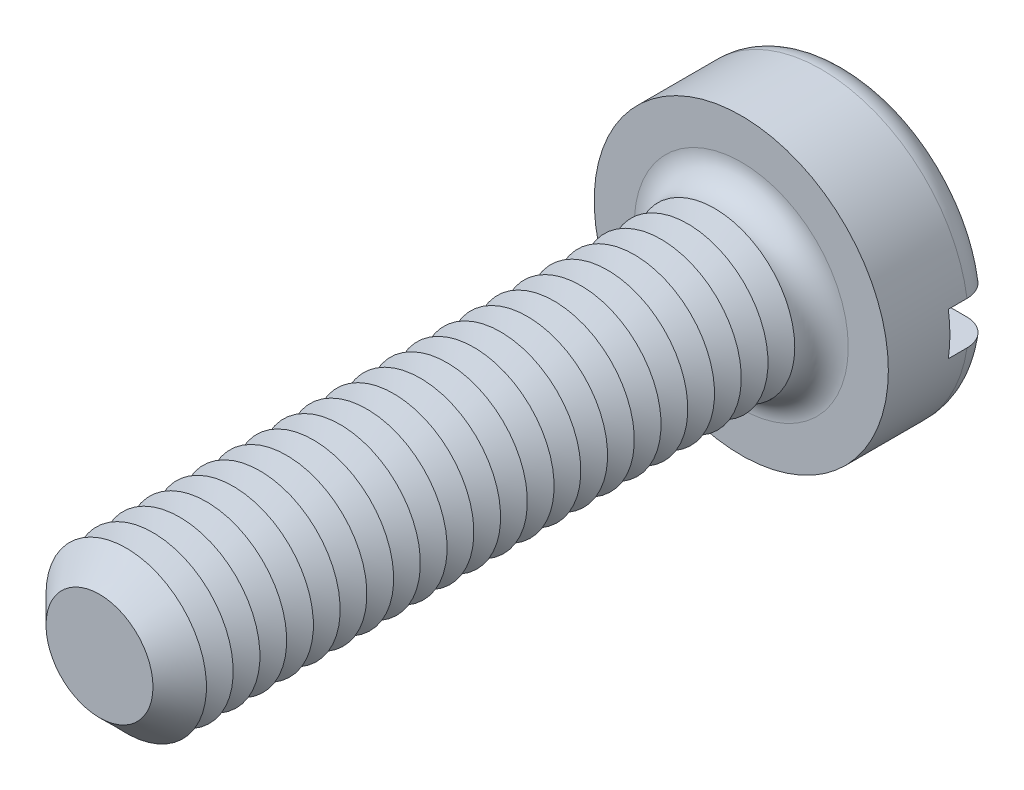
ISO-10303-21;
HEADER;
FILE_DESCRIPTION(('STEP AP214'),'2;1');
FILE_NAME('part.step','',(''),(''),'','','');
FILE_SCHEMA(('AUTOMOTIVE_DESIGN { 1 0 10303 214 1 1 1 1 }'));
ENDSEC;
DATA;
#1=APPLICATION_CONTEXT('core data for automotive mechanical design processes');
#2=APPLICATION_PROTOCOL_DEFINITION('international standard','automotive_design',2000,#1);
#3=PRODUCT_CONTEXT('',#1,'mechanical');
#4=PRODUCT('Part','Part','',(#3));
#5=PRODUCT_RELATED_PRODUCT_CATEGORY('part','',(#4));
#6=PRODUCT_DEFINITION_FORMATION('','',#4);
#7=PRODUCT_DEFINITION_CONTEXT('part definition',#1,'design');
#8=PRODUCT_DEFINITION('design','',#6,#7);
#9=PRODUCT_DEFINITION_SHAPE('','',#8);
#10=(LENGTH_UNIT() NAMED_UNIT(*) SI_UNIT(.MILLI.,.METRE.));
#11=(NAMED_UNIT(*) PLANE_ANGLE_UNIT() SI_UNIT($,.RADIAN.));
#12=(NAMED_UNIT(*) SI_UNIT($,.STERADIAN.) SOLID_ANGLE_UNIT());
#13=UNCERTAINTY_MEASURE_WITH_UNIT(LENGTH_MEASURE(1.E-05),#10,'distance_accuracy_value','');
#14=(GEOMETRIC_REPRESENTATION_CONTEXT(3) GLOBAL_UNCERTAINTY_ASSIGNED_CONTEXT((#13)) GLOBAL_UNIT_ASSIGNED_CONTEXT((#10,
#11,#12)) REPRESENTATION_CONTEXT('',''));
#15=CARTESIAN_POINT('',(0.,0.,0.));
#16=DIRECTION('',(0.,0.,1.));
#17=DIRECTION('',(1.,0.,0.));
#18=AXIS2_PLACEMENT_3D('',#15,#16,#17);
#19=CARTESIAN_POINT('',(0.,0.,-2.));
#20=DIRECTION('',(0.,0.,1.));
#21=DIRECTION('',(1.,0.,0.));
#22=AXIS2_PLACEMENT_3D('',#19,#20,#21);
#23=PLANE('',#22);
#24=CARTESIAN_POINT('',(0.,0.,-2.));
#25=DIRECTION('',(0.,0.,1.));
#26=DIRECTION('',(1.,0.,0.));
#27=AXIS2_PLACEMENT_3D('',#24,#25,#26);
#28=CIRCLE('',#27,2.25);
#29=CARTESIAN_POINT('',(-2.21415898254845,0.4,-2.));
#30=VERTEX_POINT('',#29);
#31=CARTESIAN_POINT('',(2.21415898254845,0.4,-2.));
#32=VERTEX_POINT('',#31);
#33=EDGE_CURVE('E116',#30,#32,#28,.F.);
#34=ORIENTED_EDGE('',*,*,#33,.T.);
#35=DIRECTION('',(1.,0.,0.));
#36=VECTOR('',#35,1.);
#37=CARTESIAN_POINT('',(-2.75,0.400000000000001,-2.));
#38=LINE('',#37,#36);
#39=EDGE_CURVE('E111',#30,#32,#38,.T.);
#40=ORIENTED_EDGE('',*,*,#39,.F.);
#41=EDGE_LOOP('',(#34,#40));
#42=FACE_BOUND('',#41,.T.);
#43=ADVANCED_FACE('F39',(#42),#23,.F.);
#44=CARTESIAN_POINT('',(0.,0.,-1.5));
#45=DIRECTION('',(0.,0.,1.));
#46=DIRECTION('',(1.,0.,0.));
#47=AXIS2_PLACEMENT_3D('',#44,#45,#46);
#48=TOROIDAL_SURFACE('',#47,2.25,0.5);
#49=CARTESIAN_POINT('',(-2.6296588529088,0.400000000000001,-1.78631483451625));
#50=CARTESIAN_POINT('',(-2.61332846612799,0.400000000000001,-1.80942627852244));
#51=CARTESIAN_POINT('',(-2.59501593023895,0.400000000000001,-1.83116426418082));
#52=CARTESIAN_POINT('',(-2.55497423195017,0.400000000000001,-1.87126271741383));
#53=CARTESIAN_POINT('',(-2.53324055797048,0.4,-1.88961865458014));
#54=CARTESIAN_POINT('',(-2.48702796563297,0.4,-1.92241505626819));
#55=CARTESIAN_POINT('',(-2.46255183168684,0.4,-1.93685944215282));
#56=CARTESIAN_POINT('',(-2.41154731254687,0.4,-1.96147315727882));
#57=CARTESIAN_POINT('',(-2.38501943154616,0.4,-1.97164353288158));
#58=CARTESIAN_POINT('',(-2.3303912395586,0.4,-1.98753780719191));
#59=CARTESIAN_POINT('',(-2.30227842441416,0.4,-1.99321871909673));
#60=CARTESIAN_POINT('',(-2.24549884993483,0.4,-1.99984170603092));
#61=CARTESIAN_POINT('',(-2.21683202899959,0.4,-2.00078325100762));
#62=CARTESIAN_POINT('',(-2.15939326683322,0.4,-1.99790249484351));
#63=CARTESIAN_POINT('',(-2.13062419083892,0.4,-1.99402290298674));
#64=CARTESIAN_POINT('',(-2.07413526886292,0.4,-1.98151915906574));
#65=CARTESIAN_POINT('',(-2.04641547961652,0.4,-1.97289475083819));
#66=CARTESIAN_POINT('',(-1.99264697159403,0.4,-1.95107177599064));
#67=CARTESIAN_POINT('',(-1.96660904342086,0.4,-1.93784659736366));
#68=CARTESIAN_POINT('',(-1.91713954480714,0.4,-1.90718730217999));
#69=CARTESIAN_POINT('',(-1.89370795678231,0.4,-1.88975321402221));
#70=CARTESIAN_POINT('',(-1.85029144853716,0.4,-1.85126548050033));
#71=CARTESIAN_POINT('',(-1.83028607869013,0.4,-1.83023492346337));
#72=CARTESIAN_POINT('',(-1.79417432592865,0.4,-1.78505552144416));
#73=CARTESIAN_POINT('',(-1.77806752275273,0.4,-1.76090701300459));
#74=CARTESIAN_POINT('',(-1.75056079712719,0.4,-1.71067721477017));
#75=CARTESIAN_POINT('',(-1.7390748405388,0.4,-1.68464306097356));
#76=CARTESIAN_POINT('',(-1.72075680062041,0.4,-1.63098625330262));
#77=CARTESIAN_POINT('',(-1.71392397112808,0.4,-1.60336385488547));
#78=CARTESIAN_POINT('',(-1.70525661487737,0.4,-1.54801066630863));
#79=CARTESIAN_POINT('',(-1.70330866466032,0.4,-1.52029759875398));
#80=CARTESIAN_POINT('',(-1.70414820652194,0.4,-1.46494458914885));
#81=CARTESIAN_POINT('',(-1.70693532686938,0.4,-1.43730464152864));
#82=CARTESIAN_POINT('',(-1.71709335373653,0.4,-1.38318389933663));
#83=CARTESIAN_POINT('',(-1.72441580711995,0.4,-1.35669397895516));
#84=CARTESIAN_POINT('',(-1.74335830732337,0.4,-1.30529964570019));
#85=CARTESIAN_POINT('',(-1.75497853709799,0.4,-1.2803953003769));
#86=CARTESIAN_POINT('',(-1.78229453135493,0.4,-1.23258298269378));
#87=CARTESIAN_POINT('',(-1.79803217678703,0.4,-1.20969896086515));
#88=CARTESIAN_POINT('',(-1.83304498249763,0.4,-1.16682064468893));
#89=CARTESIAN_POINT('',(-1.85232054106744,0.4,-1.1468266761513));
#90=CARTESIAN_POINT('',(-1.89433695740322,0.4,-1.10980713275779));
#91=CARTESIAN_POINT('',(-1.91714740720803,0.4,-1.09286053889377));
#92=CARTESIAN_POINT('',(-1.96524407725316,0.4,-1.06294809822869));
#93=CARTESIAN_POINT('',(-1.99053056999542,0.4,-1.04998269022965));
#94=CARTESIAN_POINT('',(-2.04340612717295,0.4,-1.02814800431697));
#95=CARTESIAN_POINT('',(-2.07103098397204,0.4,-1.01936532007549));
#96=CARTESIAN_POINT('',(-2.12735840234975,0.4,-1.00652373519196));
#97=CARTESIAN_POINT('',(-2.15606102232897,0.4,-1.00246509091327));
#98=CARTESIAN_POINT('',(-2.21395379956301,0.4,-0.999181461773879));
#99=CARTESIAN_POINT('',(-2.24314598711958,0.4,-0.999992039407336));
#100=CARTESIAN_POINT('',(-2.30097585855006,0.4,-1.00652779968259));
#101=CARTESIAN_POINT('',(-2.32961355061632,0.4,-1.01225290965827));
#102=CARTESIAN_POINT('',(-2.38536238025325,0.4,-1.02843951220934));
#103=CARTESIAN_POINT('',(-2.41248047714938,0.4,-1.03887701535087));
#104=CARTESIAN_POINT('',(-2.46454860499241,0.4,-1.06421009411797));
#105=CARTESIAN_POINT('',(-2.48949875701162,0.4,-1.0791054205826));
#106=CARTESIAN_POINT('',(-2.53620471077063,0.4,-1.11274531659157));
#107=CARTESIAN_POINT('',(-2.55799482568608,0.400000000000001,-1.1314422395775));
#108=CARTESIAN_POINT('',(-2.59807595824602,0.400000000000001,-1.17227176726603));
#109=CARTESIAN_POINT('',(-2.6163672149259,0.400000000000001,-1.19440413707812));
#110=CARTESIAN_POINT('',(-2.64868581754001,0.400000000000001,-1.24117072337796));
#111=CARTESIAN_POINT('',(-2.66276466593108,0.400000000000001,-1.26576935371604));
#112=CARTESIAN_POINT('',(-2.68654482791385,0.400000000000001,-1.31699754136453));
#113=CARTESIAN_POINT('',(-2.69624657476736,0.400000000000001,-1.34362689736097));
#114=CARTESIAN_POINT('',(-2.71090527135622,0.400000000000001,-1.39787706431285));
#115=CARTESIAN_POINT('',(-2.71590826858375,0.400000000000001,-1.4254854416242));
#116=CARTESIAN_POINT('',(-2.72118463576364,0.400000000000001,-1.48115803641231));
#117=CARTESIAN_POINT('',(-2.72145696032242,0.400000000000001,-1.50922235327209));
#118=CARTESIAN_POINT('',(-2.71727180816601,0.400000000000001,-1.56487271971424));
#119=CARTESIAN_POINT('',(-2.71283440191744,0.400000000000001,-1.59246029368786));
#120=CARTESIAN_POINT('',(-2.69939521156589,0.400000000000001,-1.64647499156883));
#121=CARTESIAN_POINT('',(-2.69039909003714,0.400000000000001,-1.67290351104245));
#122=CARTESIAN_POINT('',(-2.67251693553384,0.400000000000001,-1.71382731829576));
#123=CARTESIAN_POINT('',(-2.66497994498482,0.400000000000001,-1.72892686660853));
#124=CARTESIAN_POINT('',(-2.64841616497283,0.400000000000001,-1.75828509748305));
#125=CARTESIAN_POINT('',(-2.63938938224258,0.400000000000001,-1.77254378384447));
#126=CARTESIAN_POINT('',(-2.6296588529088,0.400000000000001,-1.78631483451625));
#127=B_SPLINE_CURVE_WITH_KNOTS('',3,(#49,#50,#51,#52,#53,#54,#55,#56,#57,#58,#59,#60,#61,#62,
#63,#64,#65,#66,#67,#68,#69,#70,#71,#72,#73,#74,#75,#76,#77,#78,#79,#80,#81,#82,#83,#84,#85,#86,
#87,#88,#89,#90,#91,#92,#93,#94,#95,#96,#97,#98,#99,#100,#101,#102,#103,#104,#105,#106,#107,
#108,#109,#110,#111,#112,#113,#114,#115,#116,#117,#118,#119,#120,#121,#122,#123,#124,#125,#126),
.UNSPECIFIED.,.T.,.F.,(4,2,2,2,2,2,2,2,2,2,2,2,2,2,2,2,2,2,2,2,2,2,2,2,2,2,2,2,2,2,2,2,2,2,2,2,
2,2,4),(0.,0.0848338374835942,0.16978050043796,0.254641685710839,0.339482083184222,
0.42512530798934,0.510778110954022,0.597458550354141,0.684143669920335,0.771338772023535,
0.858533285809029,0.945187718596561,1.03183280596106,1.11678035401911,1.20171427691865,
1.28465703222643,1.36759327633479,1.4496584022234,1.53172702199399,1.61466526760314,
1.69761285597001,1.78247103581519,1.86733856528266,1.95389396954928,2.0404540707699,
2.12764713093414,2.21483890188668,2.30159172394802,2.38833969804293,2.4740609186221,
2.55977628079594,2.6443962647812,2.72900787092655,2.81278135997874,2.89657336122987,
2.98000971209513,3.06334267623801,3.113891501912,3.16444009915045),.UNSPECIFIED.);
#128=CARTESIAN_POINT('',(-2.72075357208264,0.400000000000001,-1.50000000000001));
#129=VERTEX_POINT('',#128);
#130=EDGE_CURVE('E354',#129,#30,#127,.T.);
#131=ORIENTED_EDGE('',*,*,#130,.F.);
#132=CARTESIAN_POINT('',(0.,0.,-1.5));
#133=DIRECTION('',(0.,0.,1.));
#134=DIRECTION('',(1.,0.,0.));
#135=AXIS2_PLACEMENT_3D('',#132,#133,#134);
#136=CIRCLE('',#135,2.75);
#137=CARTESIAN_POINT('',(2.7207535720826,0.4,-1.5));
#138=VERTEX_POINT('',#137);
#139=EDGE_CURVE('E124',#138,#129,#136,.T.);
#140=ORIENTED_EDGE('',*,*,#139,.F.);
#141=CARTESIAN_POINT('',(1.7362507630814,0.4,-1.6752840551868));
#142=CARTESIAN_POINT('',(1.74636083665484,0.4,-1.70159961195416));
#143=CARTESIAN_POINT('',(1.7587429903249,0.4,-1.72706707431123));
#144=CARTESIAN_POINT('',(1.78764414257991,0.4,-1.77556609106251));
#145=CARTESIAN_POINT('',(1.80416918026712,0.4,-1.79859401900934));
#146=CARTESIAN_POINT('',(1.84080454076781,0.4,-1.84153587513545));
#147=CARTESIAN_POINT('',(1.86090949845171,0.4,-1.86145438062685));
#148=CARTESIAN_POINT('',(1.9041208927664,0.4,-1.89769607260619));
#149=CARTESIAN_POINT('',(1.92722659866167,0.4,-1.91402013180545));
#150=CARTESIAN_POINT('',(1.97620958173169,0.4,-1.94291288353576));
#151=CARTESIAN_POINT('',(2.00212726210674,0.4,-1.95541309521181));
#152=CARTESIAN_POINT('',(2.05567603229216,0.4,-1.97595143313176));
#153=CARTESIAN_POINT('',(2.08330733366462,0.4,-1.98398900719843));
#154=CARTESIAN_POINT('',(2.13989163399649,0.4,-1.99545904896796));
#155=CARTESIAN_POINT('',(2.16885726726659,0.4,-1.99882930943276));
#156=CARTESIAN_POINT('',(2.22694412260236,0.4,-2.00065872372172));
#157=CARTESIAN_POINT('',(2.25606534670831,0.4,-1.99911781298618));
#158=CARTESIAN_POINT('',(2.31362436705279,0.4,-1.99114818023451));
#159=CARTESIAN_POINT('',(2.34206235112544,0.4,-1.98472081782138));
#160=CARTESIAN_POINT('',(2.39743709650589,0.4,-1.96713601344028));
#161=CARTESIAN_POINT('',(2.42437392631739,0.4,-1.95597878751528));
#162=CARTESIAN_POINT('',(2.47569769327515,0.4,-1.92935960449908));
#163=CARTESIAN_POINT('',(2.50010686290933,0.4,-1.91394052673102));
#164=CARTESIAN_POINT('',(2.54594525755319,0.4,-1.8791725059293));
#165=CARTESIAN_POINT('',(2.56737468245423,0.4,-1.85982382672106));
#166=CARTESIAN_POINT('',(2.60634898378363,0.4,-1.81801641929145));
#167=CARTESIAN_POINT('',(2.6239407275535,0.4,-1.79560138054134));
#168=CARTESIAN_POINT('',(2.65505953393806,0.4,-1.7481077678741));
#169=CARTESIAN_POINT('',(2.66858686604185,0.4,-1.72302937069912));
#170=CARTESIAN_POINT('',(2.69103536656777,0.4,-1.67123055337));
#171=CARTESIAN_POINT('',(2.70000740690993,0.4,-1.64453217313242));
#172=CARTESIAN_POINT('',(2.71330608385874,0.4,-1.59000262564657));
#173=CARTESIAN_POINT('',(2.71763293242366,0.4,-1.5621715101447));
#174=CARTESIAN_POINT('',(2.72149675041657,0.4,-1.50637655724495));
#175=CARTESIAN_POINT('',(2.72106725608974,0.4,-1.47841503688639));
#176=CARTESIAN_POINT('',(2.7155123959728,0.4,-1.42296287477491));
#177=CARTESIAN_POINT('',(2.71038711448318,0.4,-1.39547222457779));
#178=CARTESIAN_POINT('',(2.69560462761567,0.4,-1.34178071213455));
#179=CARTESIAN_POINT('',(2.68595389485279,0.4,-1.31557806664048));
#180=CARTESIAN_POINT('',(2.66240876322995,0.4,-1.26515516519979));
#181=CARTESIAN_POINT('',(2.64851431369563,0.4,-1.24093493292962));
#182=CARTESIAN_POINT('',(2.61681930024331,0.4,-1.19504594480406));
#183=CARTESIAN_POINT('',(2.59900198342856,0.4,-1.17338876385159));
#184=CARTESIAN_POINT('',(2.56001495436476,0.4,-1.13333899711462));
#185=CARTESIAN_POINT('',(2.53884510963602,0.4,-1.11494654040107));
#186=CARTESIAN_POINT('',(2.49354554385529,0.4,-1.08175888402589));
#187=CARTESIAN_POINT('',(2.46938991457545,0.4,-1.06699905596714));
#188=CARTESIAN_POINT('',(2.41896725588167,0.4,-1.04168682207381));
#189=CARTESIAN_POINT('',(2.39270009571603,0.4,-1.03113467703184));
#190=CARTESIAN_POINT('',(2.33844927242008,0.4,-1.01439607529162));
#191=CARTESIAN_POINT('',(2.31044823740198,0.4,-1.00826592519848));
#192=CARTESIAN_POINT('',(2.25381752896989,0.4,-1.00073183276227));
#193=CARTESIAN_POINT('',(2.22518781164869,0.4,-0.999328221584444));
#194=CARTESIAN_POINT('',(2.16774231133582,0.4,-1.00127811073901));
#195=CARTESIAN_POINT('',(2.13892848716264,0.4,-1.00468955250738));
#196=CARTESIAN_POINT('',(2.08227193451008,0.4,-1.01626887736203));
#197=CARTESIAN_POINT('',(2.05442926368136,0.4,-1.02443704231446));
#198=CARTESIAN_POINT('',(2.00032604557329,0.4,-1.04537295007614));
#199=CARTESIAN_POINT('',(1.97407661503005,0.4,-1.05816944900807));
#200=CARTESIAN_POINT('',(1.92411255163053,0.4,-1.08801035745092));
#201=CARTESIAN_POINT('',(1.90039792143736,0.4,-1.10505477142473));
#202=CARTESIAN_POINT('',(1.85633574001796,0.4,-1.14282887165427));
#203=CARTESIAN_POINT('',(1.83597040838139,0.4,-1.16353779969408));
#204=CARTESIAN_POINT('',(1.79908731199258,0.4,-1.20813793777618));
#205=CARTESIAN_POINT('',(1.78256899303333,0.4,-1.23202868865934));
#206=CARTESIAN_POINT('',(1.75420022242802,0.4,-1.28183173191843));
#207=CARTESIAN_POINT('',(1.74226635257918,0.4,-1.30769648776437));
#208=CARTESIAN_POINT('',(1.72302798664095,0.4,-1.36110211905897));
#209=CARTESIAN_POINT('',(1.71572395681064,0.4,-1.38864316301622));
#210=CARTESIAN_POINT('',(1.70611974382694,0.4,-1.44392326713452));
#211=CARTESIAN_POINT('',(1.70370764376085,0.4,-1.47164298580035));
#212=CARTESIAN_POINT('',(1.70363822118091,0.4,-1.52706336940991));
#213=CARTESIAN_POINT('',(1.70597448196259,0.4,-1.55476400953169));
#214=CARTESIAN_POINT('',(1.71335146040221,0.4,-1.59796127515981));
#215=CARTESIAN_POINT('',(1.71686033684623,0.4,-1.61373520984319));
#216=CARTESIAN_POINT('',(1.7254146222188,0.4,-1.64486018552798));
#217=CARTESIAN_POINT('',(1.73045999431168,0.4,-1.66021123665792));
#218=CARTESIAN_POINT('',(1.7362507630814,0.4,-1.6752840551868));
#219=B_SPLINE_CURVE_WITH_KNOTS('',3,(#141,#142,#143,#144,#145,#146,#147,#148,#149,#150,#151,
#152,#153,#154,#155,#156,#157,#158,#159,#160,#161,#162,#163,#164,#165,#166,#167,#168,#169,#170,
#171,#172,#173,#174,#175,#176,#177,#178,#179,#180,#181,#182,#183,#184,#185,#186,#187,#188,#189,
#190,#191,#192,#193,#194,#195,#196,#197,#198,#199,#200,#201,#202,#203,#204,#205,#206,#207,#208,
#209,#210,#211,#212,#213,#214,#215,#216,#217,#218),.UNSPECIFIED.,.T.,.F.,(4,2,2,2,2,2,2,2,2,2,2,
2,2,2,2,2,2,2,2,2,2,2,2,2,2,2,2,2,2,2,2,2,2,2,2,2,2,2,4),(0.,0.0845117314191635,
0.169147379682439,0.253657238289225,0.338146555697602,0.424070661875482,0.510005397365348,
0.597074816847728,0.684145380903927,0.771191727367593,0.858234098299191,0.94443074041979,
1.03062159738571,1.11569223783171,1.20075723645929,1.28485012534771,1.36893917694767,
1.45243570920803,1.53593074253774,1.61930671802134,1.70268368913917,1.7864238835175,
1.87016738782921,1.95469664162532,2.03923113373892,2.12482389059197,2.21042264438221,
2.29706026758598,2.38370302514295,2.47089361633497,2.55808429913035,2.64479602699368,
2.73149525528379,2.81653234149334,2.9015779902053,2.98465497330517,3.06761976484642,
3.11602689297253,3.164432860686),.UNSPECIFIED.);
#220=EDGE_CURVE('E356',#32,#138,#219,.T.);
#221=ORIENTED_EDGE('',*,*,#220,.F.);
#222=ORIENTED_EDGE('',*,*,#33,.F.);
#223=EDGE_LOOP('',(#131,#140,#221,#222));
#224=FACE_BOUND('',#223,.T.);
#225=ADVANCED_FACE('F338',(#224),#48,.T.);
#226=CARTESIAN_POINT('',(0.,0.,-2.));
#227=DIRECTION('',(0.,0.,1.));
#228=DIRECTION('',(1.,0.,0.));
#229=AXIS2_PLACEMENT_3D('',#226,#227,#228);
#230=CYLINDRICAL_SURFACE('',#229,2.75);
#231=DIRECTION('',(0.,0.,1.));
#232=VECTOR('',#231,1.);
#233=CARTESIAN_POINT('',(2.72075357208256,0.4,-2.));
#234=LINE('',#233,#232);
#235=CARTESIAN_POINT('',(2.72075357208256,0.4,-1.15));
#236=VERTEX_POINT('',#235);
#237=EDGE_CURVE('E369',#138,#236,#234,.T.);
#238=ORIENTED_EDGE('',*,*,#237,.F.);
#239=ORIENTED_EDGE('',*,*,#139,.T.);
#240=DIRECTION('',(0.,0.,1.));
#241=VECTOR('',#240,1.);
#242=CARTESIAN_POINT('',(-2.72075357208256,0.4,-2.));
#243=LINE('',#242,#241);
#244=CARTESIAN_POINT('',(-2.72075357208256,0.4,-1.15));
#245=VERTEX_POINT('',#244);
#246=EDGE_CURVE('E63',#245,#129,#243,.F.);
#247=ORIENTED_EDGE('',*,*,#246,.F.);
#248=CARTESIAN_POINT('',(0.,0.,-1.15));
#249=DIRECTION('',(0.,0.,-1.));
#250=DIRECTION('',(-1.,0.,0.));
#251=AXIS2_PLACEMENT_3D('',#248,#249,#250);
#252=CIRCLE('',#251,2.75);
#253=CARTESIAN_POINT('',(-2.72075357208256,-0.4,-1.15));
#254=VERTEX_POINT('',#253);
#255=EDGE_CURVE('E43',#245,#254,#252,.F.);
#256=ORIENTED_EDGE('',*,*,#255,.T.);
#257=DIRECTION('',(0.,0.,1.));
#258=VECTOR('',#257,1.);
#259=CARTESIAN_POINT('',(-2.72075357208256,-0.4,-2.));
#260=LINE('',#259,#258);
#261=CARTESIAN_POINT('',(-2.72075357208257,-0.4,-1.5));
#262=VERTEX_POINT('',#261);
#263=EDGE_CURVE('E366',#262,#254,#260,.T.);
#264=ORIENTED_EDGE('',*,*,#263,.F.);
#265=CARTESIAN_POINT('',(2.72075357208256,-0.4,-1.5));
#266=VERTEX_POINT('',#265);
#267=EDGE_CURVE('E126',#262,#266,#136,.T.);
#268=ORIENTED_EDGE('',*,*,#267,.T.);
#269=DIRECTION('',(0.,0.,1.));
#270=VECTOR('',#269,1.);
#271=CARTESIAN_POINT('',(2.72075357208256,-0.4,-2.));
#272=LINE('',#271,#270);
#273=CARTESIAN_POINT('',(2.72075357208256,-0.4,-1.15));
#274=VERTEX_POINT('',#273);
#275=EDGE_CURVE('E55',#274,#266,#272,.F.);
#276=ORIENTED_EDGE('',*,*,#275,.F.);
#277=EDGE_CURVE('E11',#274,#236,#252,.F.);
#278=ORIENTED_EDGE('',*,*,#277,.T.);
#279=EDGE_LOOP('',(#238,#239,#247,#256,#264,#268,#276,#278));
#280=FACE_BOUND('',#279,.T.);
#281=CARTESIAN_POINT('',(0.,0.,0.));
#282=DIRECTION('',(0.,0.,1.));
#283=DIRECTION('',(1.,0.,0.));
#284=AXIS2_PLACEMENT_3D('',#281,#282,#283);
#285=CIRCLE('',#284,2.75);
#286=CARTESIAN_POINT('',(2.75,0.,0.));
#287=VERTEX_POINT('',#286);
#288=EDGE_CURVE('E372',#287,#287,#285,.T.);
#289=ORIENTED_EDGE('',*,*,#288,.F.);
#290=EDGE_LOOP('',(#289));
#291=FACE_BOUND('',#290,.T.);
#292=ADVANCED_FACE('F334',(#280,#291),#230,.T.);
#293=CARTESIAN_POINT('',(2.21415898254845,-0.4,-2.));
#294=VERTEX_POINT('',#293);
#295=CARTESIAN_POINT('',(-2.21415898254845,-0.4,-2.));
#296=VERTEX_POINT('',#295);
#297=EDGE_CURVE('E109',#294,#296,#28,.F.);
#298=ORIENTED_EDGE('',*,*,#297,.T.);
#299=DIRECTION('',(-1.,0.,0.));
#300=VECTOR('',#299,1.);
#301=CARTESIAN_POINT('',(-2.75,-0.4,-2.));
#302=LINE('',#301,#300);
#303=EDGE_CURVE('E96',#294,#296,#302,.T.);
#304=ORIENTED_EDGE('',*,*,#303,.F.);
#305=EDGE_LOOP('',(#298,#304));
#306=FACE_BOUND('',#305,.T.);
#307=ADVANCED_FACE('F108',(#306),#23,.F.);
#308=CARTESIAN_POINT('',(0.,0.,0.));
#309=DIRECTION('',(0.,0.,1.));
#310=DIRECTION('',(1.,0.,0.));
#311=AXIS2_PLACEMENT_3D('',#308,#309,#310);
#312=PLANE('',#311);
#313=CARTESIAN_POINT('',(0.,0.,0.));
#314=DIRECTION('',(0.,0.,1.));
#315=DIRECTION('',(1.,0.,0.));
#316=AXIS2_PLACEMENT_3D('',#313,#314,#315);
#317=CIRCLE('',#316,2.);
#318=CARTESIAN_POINT('',(2.,0.,0.));
#319=VERTEX_POINT('',#318);
#320=EDGE_CURVE('E115',#319,#319,#317,.F.);
#321=ORIENTED_EDGE('',*,*,#320,.T.);
#322=EDGE_LOOP('',(#321));
#323=FACE_BOUND('',#322,.T.);
#324=ORIENTED_EDGE('',*,*,#288,.T.);
#325=EDGE_LOOP('',(#324));
#326=FACE_BOUND('',#325,.T.);
#327=ADVANCED_FACE('F333',(#323,#326),#312,.T.);
#328=CARTESIAN_POINT('',(-2.6296588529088,-0.4,-1.78631483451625));
#329=CARTESIAN_POINT('',(-2.64575286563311,-0.4,-1.76353353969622));
#330=CARTESIAN_POINT('',(-2.65994473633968,-0.4,-1.73938506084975));
#331=CARTESIAN_POINT('',(-2.68408879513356,-0.4,-1.68903091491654));
#332=CARTESIAN_POINT('',(-2.69403633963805,-0.4,-1.6628230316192));
#333=CARTESIAN_POINT('',(-2.70937899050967,-0.4,-1.60911025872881));
#334=CARTESIAN_POINT('',(-2.71477511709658,-0.4,-1.5816056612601));
#335=CARTESIAN_POINT('',(-2.72085365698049,-0.4,-1.52608718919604));
#336=CARTESIAN_POINT('',(-2.7215371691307,-0.4,-1.49807343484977));
#337=CARTESIAN_POINT('',(-2.71817903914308,-0.4,-1.44242333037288));
#338=CARTESIAN_POINT('',(-2.71415291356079,-0.4,-1.41478604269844));
#339=CARTESIAN_POINT('',(-2.70152104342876,-0.4,-1.36057835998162));
#340=CARTESIAN_POINT('',(-2.69291517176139,-0.4,-1.33400799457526));
#341=CARTESIAN_POINT('',(-2.67137052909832,-0.4,-1.28266198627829));
#342=CARTESIAN_POINT('',(-2.65842829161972,-0.4,-1.25788779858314));
#343=CARTESIAN_POINT('',(-2.62859348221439,-0.4,-1.21084577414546));
#344=CARTESIAN_POINT('',(-2.61170082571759,-0.4,-1.18857799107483));
#345=CARTESIAN_POINT('',(-2.5743351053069,-0.4,-1.1470221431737));
#346=CARTESIAN_POINT('',(-2.55383974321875,-0.4,-1.12775413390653));
#347=CARTESIAN_POINT('',(-2.5099353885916,-0.4,-1.09288845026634));
#348=CARTESIAN_POINT('',(-2.48652625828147,-0.4,-1.07729094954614));
#349=CARTESIAN_POINT('',(-2.43718903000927,-0.4,-1.0500239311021));
#350=CARTESIAN_POINT('',(-2.41123629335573,-0.4,-1.0383990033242));
#351=CARTESIAN_POINT('',(-2.35776417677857,-0.4,-1.01960886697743));
#352=CARTESIAN_POINT('',(-2.33024469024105,-0.4,-1.01244396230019));
#353=CARTESIAN_POINT('',(-2.27404134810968,-0.4,-1.00268156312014));
#354=CARTESIAN_POINT('',(-2.24534705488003,-0.4,-1.00014414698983));
#355=CARTESIAN_POINT('',(-2.18793513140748,-0.4,-0.999867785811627));
#356=CARTESIAN_POINT('',(-2.15921749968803,-0.4,-1.00212917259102));
#357=CARTESIAN_POINT('',(-2.10225052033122,-0.4,-1.01142552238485));
#358=CARTESIAN_POINT('',(-2.07400941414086,-0.4,-1.01851105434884));
#359=CARTESIAN_POINT('',(-2.01911044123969,-0.4,-1.03730994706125));
#360=CARTESIAN_POINT('',(-1.99245264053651,-0.4,-1.04902350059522));
#361=CARTESIAN_POINT('',(-1.94142108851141,-0.4,-1.07679847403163));
#362=CARTESIAN_POINT('',(-1.91705303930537,-0.4,-1.09287038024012));
#363=CARTESIAN_POINT('',(-1.87139758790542,-0.4,-1.12891897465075));
#364=CARTESIAN_POINT('',(-1.85011007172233,-0.4,-1.14889551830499));
#365=CARTESIAN_POINT('',(-1.81149058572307,-0.4,-1.19196940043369));
#366=CARTESIAN_POINT('',(-1.79411779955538,-0.4,-1.21503011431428));
#367=CARTESIAN_POINT('',(-1.76359546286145,-0.4,-1.26379588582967));
#368=CARTESIAN_POINT('',(-1.75044532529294,-0.4,-1.28950057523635));
#369=CARTESIAN_POINT('',(-1.72906221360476,-0.4,-1.3422057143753));
#370=CARTESIAN_POINT('',(-1.72072512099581,-0.4,-1.3691639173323));
#371=CARTESIAN_POINT('',(-1.70880448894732,-0.4,-1.42411084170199));
#372=CARTESIAN_POINT('',(-1.7052202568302,-0.4,-1.45209941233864));
#373=CARTESIAN_POINT('',(-1.70295553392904,-0.4,-1.50768522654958));
#374=CARTESIAN_POINT('',(-1.70417398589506,-0.4,-1.53527840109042));
#375=CARTESIAN_POINT('',(-1.71124536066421,-0.4,-1.58986292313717));
#376=CARTESIAN_POINT('',(-1.71709811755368,-0.4,-1.61685429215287));
#377=CARTESIAN_POINT('',(-1.73321132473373,-0.4,-1.66938107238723));
#378=CARTESIAN_POINT('',(-1.74345625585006,-0.4,-1.69492125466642));
#379=CARTESIAN_POINT('',(-1.76802111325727,-0.4,-1.74395877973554));
#380=CARTESIAN_POINT('',(-1.78234133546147,-0.4,-1.76745597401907));
#381=CARTESIAN_POINT('',(-1.81488631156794,-0.4,-1.81216193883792));
#382=CARTESIAN_POINT('',(-1.83317116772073,-0.4,-1.83332693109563));
#383=CARTESIAN_POINT('',(-1.87296030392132,-0.4,-1.872375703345));
#384=CARTESIAN_POINT('',(-1.89446497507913,-0.4,-1.89025908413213));
#385=CARTESIAN_POINT('',(-1.94063077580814,-0.4,-1.92267732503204));
#386=CARTESIAN_POINT('',(-1.96535444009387,-0.4,-1.93712316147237));
#387=CARTESIAN_POINT('',(-2.01684705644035,-0.4,-1.96173690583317));
#388=CARTESIAN_POINT('',(-2.04361620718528,-0.4,-1.97190439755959));
#389=CARTESIAN_POINT('',(-2.09891021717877,-0.4,-1.9878230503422));
#390=CARTESIAN_POINT('',(-2.12745653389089,-0.4,-1.99349978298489));
#391=CARTESIAN_POINT('',(-2.18509639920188,-0.4,-1.99999556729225));
#392=CARTESIAN_POINT('',(-2.21418994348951,-0.4,-2.00081465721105));
#393=CARTESIAN_POINT('',(-2.27218032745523,-0.4,-1.99755156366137));
#394=CARTESIAN_POINT('',(-2.30107643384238,-0.4,-1.99345627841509));
#395=CARTESIAN_POINT('',(-2.35776697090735,-0.4,-1.98043125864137));
#396=CARTESIAN_POINT('',(-2.38556116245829,-0.4,-1.97150048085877));
#397=CARTESIAN_POINT('',(-2.43901832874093,-0.4,-1.94912081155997));
#398=CARTESIAN_POINT('',(-2.46469578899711,-0.4,-1.93570648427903));
#399=CARTESIAN_POINT('',(-2.51337022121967,-0.4,-1.90471183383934));
#400=CARTESIAN_POINT('',(-2.53637056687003,-0.4,-1.88713684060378));
#401=CARTESIAN_POINT('',(-2.57111030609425,-0.4,-1.85552084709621));
#402=CARTESIAN_POINT('',(-2.58386709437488,-0.4,-1.84257896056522));
#403=CARTESIAN_POINT('',(-2.60790410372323,-0.4,-1.81538935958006));
#404=CARTESIAN_POINT('',(-2.61918433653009,-0.4,-1.80114165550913));
#405=CARTESIAN_POINT('',(-2.6296588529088,-0.4,-1.78631483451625));
#406=B_SPLINE_CURVE_WITH_KNOTS('',3,(#328,#329,#330,#331,#332,#333,#334,#335,#336,#337,#338,
#339,#340,#341,#342,#343,#344,#345,#346,#347,#348,#349,#350,#351,#352,#353,#354,#355,#356,#357,
#358,#359,#360,#361,#362,#363,#364,#365,#366,#367,#368,#369,#370,#371,#372,#373,#374,#375,#376,
#377,#378,#379,#380,#381,#382,#383,#384,#385,#386,#387,#388,#389,#390,#391,#392,#393,#394,#395,
#396,#397,#398,#399,#400,#401,#402,#403,#404,#405),.UNSPECIFIED.,.T.,.F.,(4,2,2,2,2,2,2,2,2,2,2,
2,2,2,2,2,2,2,2,2,2,2,2,2,2,2,2,2,2,2,2,2,2,2,2,2,2,2,4),(0.,0.0836125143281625,
0.167316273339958,0.251001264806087,0.334666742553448,0.418057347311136,0.501450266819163,
0.584910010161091,0.668371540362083,0.752369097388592,0.836370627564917,0.921286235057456,
1.00620762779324,1.09222390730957,1.17824613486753,1.26518425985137,1.35212600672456,
1.43927882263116,1.52642841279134,1.61262232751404,1.69880425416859,1.7830443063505,
1.86727208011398,1.9497371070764,2.03219918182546,2.1143722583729,2.19655130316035,
2.28007615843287,2.36361116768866,2.44911836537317,2.53463387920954,2.62153862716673,
2.70844269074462,2.79557895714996,2.88273403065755,2.96923214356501,3.05562004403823,
3.11003826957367,3.16445606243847),.UNSPECIFIED.);
#407=EDGE_CURVE('E103',#296,#262,#406,.T.);
#408=ORIENTED_EDGE('',*,*,#407,.F.);
#409=ORIENTED_EDGE('',*,*,#297,.F.);
#410=CARTESIAN_POINT('',(1.7362507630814,-0.4,-1.6752840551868));
#411=CARTESIAN_POINT('',(1.72641416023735,-0.4,-1.64967314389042));
#412=CARTESIAN_POINT('',(1.71871480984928,-0.4,-1.62322216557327));
#413=CARTESIAN_POINT('',(1.70786038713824,-0.4,-1.56938399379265));
#414=CARTESIAN_POINT('',(1.70470970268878,-0.4,-1.54199592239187));
#415=CARTESIAN_POINT('',(1.70306971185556,-0.4,-1.48708393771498));
#416=CARTESIAN_POINT('',(1.70457942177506,-0.4,-1.45956005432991));
#417=CARTESIAN_POINT('',(1.71220670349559,-0.4,-1.40516538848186));
#418=CARTESIAN_POINT('',(1.71832341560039,-0.4,-1.3782944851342));
#419=CARTESIAN_POINT('',(1.73494792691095,-0.4,-1.32598312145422));
#420=CARTESIAN_POINT('',(1.74545076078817,-0.4,-1.30054108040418));
#421=CARTESIAN_POINT('',(1.77051013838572,-0.4,-1.25173932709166));
#422=CARTESIAN_POINT('',(1.7850670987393,-0.4,-1.22837982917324));
#423=CARTESIAN_POINT('',(1.81806903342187,-0.4,-1.1839775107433));
#424=CARTESIAN_POINT('',(1.8365752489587,-0.4,-1.16298023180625));
#425=CARTESIAN_POINT('',(1.87677669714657,-0.4,-1.1243010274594));
#426=CARTESIAN_POINT('',(1.89847230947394,-0.4,-1.10661949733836));
#427=CARTESIAN_POINT('',(1.94498854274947,-0.4,-1.07463966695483));
#428=CARTESIAN_POINT('',(1.96987078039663,-0.4,-1.06043095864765));
#429=CARTESIAN_POINT('',(2.02163980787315,-0.4,-1.0363161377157));
#430=CARTESIAN_POINT('',(2.04852678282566,-0.4,-1.02641042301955));
#431=CARTESIAN_POINT('',(2.10400319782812,-0.4,-1.01104128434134));
#432=CARTESIAN_POINT('',(2.13261287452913,-0.4,-1.00565079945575));
#433=CARTESIAN_POINT('',(2.19033179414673,-0.4,-0.999735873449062));
#434=CARTESIAN_POINT('',(2.2194410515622,-0.4,-0.999211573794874));
#435=CARTESIAN_POINT('',(2.27740442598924,-0.4,-1.00306591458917));
#436=CARTESIAN_POINT('',(2.30625777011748,-0.4,-1.00745623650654));
#437=CARTESIAN_POINT('',(2.36280530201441,-0.4,-1.02105937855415));
#438=CARTESIAN_POINT('',(2.39049952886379,-0.4,-1.03027203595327));
#439=CARTESIAN_POINT('',(2.44369359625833,-0.4,-1.05318710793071));
#440=CARTESIAN_POINT('',(2.46920965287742,-0.4,-1.0668518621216));
#441=CARTESIAN_POINT('',(2.51754507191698,-0.4,-1.09832423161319));
#442=CARTESIAN_POINT('',(2.54036461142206,-0.4,-1.11613157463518));
#443=CARTESIAN_POINT('',(2.58234752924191,-0.4,-1.15513986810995));
#444=CARTESIAN_POINT('',(2.601553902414,-0.4,-1.1762945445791));
#445=CARTESIAN_POINT('',(2.63609001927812,-0.4,-1.22156192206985));
#446=CARTESIAN_POINT('',(2.65142002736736,-0.4,-1.24567442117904));
#447=CARTESIAN_POINT('',(2.67757733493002,-0.4,-1.29585881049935));
#448=CARTESIAN_POINT('',(2.68845668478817,-0.4,-1.32190357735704));
#449=CARTESIAN_POINT('',(2.7056478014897,-0.4,-1.375459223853));
#450=CARTESIAN_POINT('',(2.71195980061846,-0.4,-1.40297002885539));
#451=CARTESIAN_POINT('',(2.71979288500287,-0.4,-1.45843707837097));
#452=CARTESIAN_POINT('',(2.72135241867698,-0.4,-1.48638789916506));
#453=CARTESIAN_POINT('',(2.71974298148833,-0.4,-1.54215266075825));
#454=CARTESIAN_POINT('',(2.71657412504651,-0.4,-1.56996660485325));
#455=CARTESIAN_POINT('',(2.70561779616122,-0.4,-1.62459191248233));
#456=CARTESIAN_POINT('',(2.69784258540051,-0.4,-1.65140573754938));
#457=CARTESIAN_POINT('',(2.6779146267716,-0.4,-1.70335337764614));
#458=CARTESIAN_POINT('',(2.66576185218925,-0.4,-1.72848718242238));
#459=CARTESIAN_POINT('',(2.63739107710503,-0.4,-1.77645196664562));
#460=CARTESIAN_POINT('',(2.62116029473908,-0.4,-1.79927538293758));
#461=CARTESIAN_POINT('',(2.58512700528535,-0.4,-1.84190182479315));
#462=CARTESIAN_POINT('',(2.56532438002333,-0.4,-1.86170475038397));
#463=CARTESIAN_POINT('',(2.522535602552,-0.4,-1.89791219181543));
#464=CARTESIAN_POINT('',(2.49952399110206,-0.4,-1.91428661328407));
#465=CARTESIAN_POINT('',(2.45110500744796,-0.4,-1.94299324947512));
#466=CARTESIAN_POINT('',(2.4256974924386,-0.4,-1.95532522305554));
#467=CARTESIAN_POINT('',(2.37288090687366,-0.4,-1.97575769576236));
#468=CARTESIAN_POINT('',(2.34545135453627,-0.4,-1.98380524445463));
#469=CARTESIAN_POINT('',(2.28963821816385,-0.4,-1.99524443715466));
#470=CARTESIAN_POINT('',(2.26125456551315,-0.4,-1.99863574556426));
#471=CARTESIAN_POINT('',(2.20395671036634,-0.4,-2.00070487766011));
#472=CARTESIAN_POINT('',(2.17504033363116,-0.4,-1.99932265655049));
#473=CARTESIAN_POINT('',(2.11784130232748,-0.4,-1.9917648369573));
#474=CARTESIAN_POINT('',(2.08955866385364,-0.4,-1.98558911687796));
#475=CARTESIAN_POINT('',(2.03419451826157,-0.4,-1.96854979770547));
#476=CARTESIAN_POINT('',(2.00712437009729,-0.4,-1.95764925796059));
#477=CARTESIAN_POINT('',(1.95519572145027,-0.4,-1.93144413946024));
#478=CARTESIAN_POINT('',(1.93033780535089,-0.4,-1.91613840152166));
#479=CARTESIAN_POINT('',(1.88362525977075,-0.4,-1.88157419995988));
#480=CARTESIAN_POINT('',(1.86176428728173,-0.4,-1.86232430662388));
#481=CARTESIAN_POINT('',(1.82167218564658,-0.4,-1.82038600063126));
#482=CARTESIAN_POINT('',(1.803436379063,-0.4,-1.7977020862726));
#483=CARTESIAN_POINT('',(1.77700088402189,-0.4,-1.7582526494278));
#484=CARTESIAN_POINT('',(1.7675549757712,-0.4,-1.74230781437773));
#485=CARTESIAN_POINT('',(1.75049861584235,-0.4,-1.70946415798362));
#486=CARTESIAN_POINT('',(1.7428881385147,-0.4,-1.69256534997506));
#487=CARTESIAN_POINT('',(1.7362507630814,-0.4,-1.6752840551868));
#488=B_SPLINE_CURVE_WITH_KNOTS('',3,(#410,#411,#412,#413,#414,#415,#416,#417,#418,#419,#420,
#421,#422,#423,#424,#425,#426,#427,#428,#429,#430,#431,#432,#433,#434,#435,#436,#437,#438,#439,
#440,#441,#442,#443,#444,#445,#446,#447,#448,#449,#450,#451,#452,#453,#454,#455,#456,#457,#458,
#459,#460,#461,#462,#463,#464,#465,#466,#467,#468,#469,#470,#471,#472,#473,#474,#475,#476,#477,
#478,#479,#480,#481,#482,#483,#484,#485,#486,#487),.UNSPECIFIED.,.T.,.F.,(4,2,2,2,2,2,2,2,2,2,2,
2,2,2,2,2,2,2,2,2,2,2,2,2,2,2,2,2,2,2,2,2,2,2,2,2,2,2,4),(0.,0.0822382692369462,
0.164555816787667,0.246855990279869,0.329140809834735,0.411332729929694,0.493533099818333,
0.577115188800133,0.660707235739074,0.746270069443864,0.831840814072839,0.918768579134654,
1.00569887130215,1.09283622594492,1.17997064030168,1.26638632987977,1.35279634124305,
1.43810213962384,1.52340211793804,1.60767384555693,1.69194128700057,1.77552515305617,
1.85910699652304,1.94246734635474,2.02582820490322,2.10945367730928,2.19308191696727,
2.2774160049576,2.36175512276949,2.4471137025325,2.53247843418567,2.61892083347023,
2.70536542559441,2.79249842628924,2.87965437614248,2.96662291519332,3.05347850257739,
3.10897061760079,3.16446195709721),.UNSPECIFIED.);
#489=EDGE_CURVE('E92',#266,#294,#488,.T.);
#490=ORIENTED_EDGE('',*,*,#489,.F.);
#491=ORIENTED_EDGE('',*,*,#267,.F.);
#492=EDGE_LOOP('',(#408,#409,#490,#491));
#493=FACE_BOUND('',#492,.T.);
#494=ADVANCED_FACE('F113',(#493),#48,.T.);
#495=CARTESIAN_POINT('',(0.,0.,0.5));
#496=DIRECTION('',(0.,0.,1.));
#497=DIRECTION('',(1.,0.,0.));
#498=AXIS2_PLACEMENT_3D('',#495,#496,#497);
#499=TOROIDAL_SURFACE('',#498,2.,0.5);
#500=ORIENTED_EDGE('',*,*,#320,.F.);
#501=EDGE_LOOP('',(#500));
#502=FACE_BOUND('',#501,.T.);
#503=CARTESIAN_POINT('',(0.,0.,0.5));
#504=DIRECTION('',(0.,0.,-1.));
#505=DIRECTION('',(-1.,0.,0.));
#506=AXIS2_PLACEMENT_3D('',#503,#504,#505);
#507=CIRCLE('',#506,1.5);
#508=CARTESIAN_POINT('',(-1.5,0.,0.5));
#509=VERTEX_POINT('',#508);
#510=EDGE_CURVE('E377',#509,#509,#507,.T.);
#511=ORIENTED_EDGE('',*,*,#510,.T.);
#512=EDGE_LOOP('',(#511));
#513=FACE_BOUND('',#512,.T.);
#514=ADVANCED_FACE('F326',(#502,#513),#499,.F.);
#515=CARTESIAN_POINT('',(0.,0.,0.750000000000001));
#516=DIRECTION('',(0.,0.,-1.));
#517=DIRECTION('',(-1.,0.,0.));
#518=AXIS2_PLACEMENT_3D('',#515,#516,#517);
#519=CONICAL_SURFACE('',#518,1.06698729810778,1.0471975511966);
#520=ORIENTED_EDGE('',*,*,#510,.F.);
#521=EDGE_LOOP('',(#520));
#522=FACE_BOUND('',#521,.T.);
#523=CARTESIAN_POINT('',(0.,0.,0.750000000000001));
#524=DIRECTION('',(0.,0.,-1.));
#525=DIRECTION('',(-1.,0.,0.));
#526=AXIS2_PLACEMENT_3D('',#523,#524,#525);
#527=CIRCLE('',#526,1.06698729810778);
#528=CARTESIAN_POINT('',(-1.06698729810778,0.,0.750000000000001));
#529=VERTEX_POINT('',#528);
#530=EDGE_CURVE('E384',#529,#529,#527,.T.);
#531=ORIENTED_EDGE('',*,*,#530,.T.);
#532=EDGE_LOOP('',(#531));
#533=FACE_BOUND('',#532,.T.);
#534=ADVANCED_FACE('F322',(#522,#533),#519,.T.);
#535=CARTESIAN_POINT('',(0.,0.,1.));
#536=DIRECTION('',(0.,0.,1.));
#537=DIRECTION('',(1.,0.,0.));
#538=AXIS2_PLACEMENT_3D('',#535,#536,#537);
#539=CONICAL_SURFACE('',#538,1.5,1.0471975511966);
#540=ORIENTED_EDGE('',*,*,#530,.F.);
#541=EDGE_LOOP('',(#540));
#542=FACE_BOUND('',#541,.T.);
#543=CARTESIAN_POINT('',(0.,0.,1.));
#544=DIRECTION('',(0.,0.,-1.));
#545=DIRECTION('',(-1.,0.,0.));
#546=AXIS2_PLACEMENT_3D('',#543,#544,#545);
#547=CIRCLE('',#546,1.5);
#548=CARTESIAN_POINT('',(-1.5,0.,1.));
#549=VERTEX_POINT('',#548);
#550=EDGE_CURVE('E390',#549,#549,#547,.T.);
#551=ORIENTED_EDGE('',*,*,#550,.T.);
#552=EDGE_LOOP('',(#551));
#553=FACE_BOUND('',#552,.T.);
#554=ADVANCED_FACE('F318',(#542,#553),#539,.T.);
#555=CARTESIAN_POINT('',(0.,0.,1.25));
#556=DIRECTION('',(0.,0.,-1.));
#557=DIRECTION('',(-1.,0.,0.));
#558=AXIS2_PLACEMENT_3D('',#555,#556,#557);
#559=CONICAL_SURFACE('',#558,1.06698729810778,1.0471975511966);
#560=ORIENTED_EDGE('',*,*,#550,.F.);
#561=EDGE_LOOP('',(#560));
#562=FACE_BOUND('',#561,.T.);
#563=CARTESIAN_POINT('',(0.,0.,1.25));
#564=DIRECTION('',(0.,0.,-1.));
#565=DIRECTION('',(-1.,0.,0.));
#566=AXIS2_PLACEMENT_3D('',#563,#564,#565);
#567=CIRCLE('',#566,1.06698729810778);
#568=CARTESIAN_POINT('',(-1.06698729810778,0.,1.25));
#569=VERTEX_POINT('',#568);
#570=EDGE_CURVE('E394',#569,#569,#567,.T.);
#571=ORIENTED_EDGE('',*,*,#570,.T.);
#572=EDGE_LOOP('',(#571));
#573=FACE_BOUND('',#572,.T.);
#574=ADVANCED_FACE('F314',(#562,#573),#559,.T.);
#575=CARTESIAN_POINT('',(0.,0.,1.5));
#576=DIRECTION('',(0.,0.,1.));
#577=DIRECTION('',(1.,0.,0.));
#578=AXIS2_PLACEMENT_3D('',#575,#576,#577);
#579=CONICAL_SURFACE('',#578,1.5,1.0471975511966);
#580=ORIENTED_EDGE('',*,*,#570,.F.);
#581=EDGE_LOOP('',(#580));
#582=FACE_BOUND('',#581,.T.);
#583=CARTESIAN_POINT('',(0.,0.,1.5));
#584=DIRECTION('',(0.,0.,-1.));
#585=DIRECTION('',(-1.,0.,0.));
#586=AXIS2_PLACEMENT_3D('',#583,#584,#585);
#587=CIRCLE('',#586,1.5);
#588=CARTESIAN_POINT('',(-1.5,0.,1.5));
#589=VERTEX_POINT('',#588);
#590=EDGE_CURVE('E397',#589,#589,#587,.T.);
#591=ORIENTED_EDGE('',*,*,#590,.T.);
#592=EDGE_LOOP('',(#591));
#593=FACE_BOUND('',#592,.T.);
#594=ADVANCED_FACE('F310',(#582,#593),#579,.T.);
#595=CARTESIAN_POINT('',(0.,0.,1.75));
#596=DIRECTION('',(0.,0.,-1.));
#597=DIRECTION('',(-1.,0.,0.));
#598=AXIS2_PLACEMENT_3D('',#595,#596,#597);
#599=CONICAL_SURFACE('',#598,1.06698729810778,1.0471975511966);
#600=ORIENTED_EDGE('',*,*,#590,.F.);
#601=EDGE_LOOP('',(#600));
#602=FACE_BOUND('',#601,.T.);
#603=CARTESIAN_POINT('',(0.,0.,1.75));
#604=DIRECTION('',(0.,0.,-1.));
#605=DIRECTION('',(-1.,0.,0.));
#606=AXIS2_PLACEMENT_3D('',#603,#604,#605);
#607=CIRCLE('',#606,1.06698729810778);
#608=CARTESIAN_POINT('',(-1.06698729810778,0.,1.75));
#609=VERTEX_POINT('',#608);
#610=EDGE_CURVE('E401',#609,#609,#607,.T.);
#611=ORIENTED_EDGE('',*,*,#610,.T.);
#612=EDGE_LOOP('',(#611));
#613=FACE_BOUND('',#612,.T.);
#614=ADVANCED_FACE('F306',(#602,#613),#599,.T.);
#615=CARTESIAN_POINT('',(0.,0.,2.));
#616=DIRECTION('',(0.,0.,1.));
#617=DIRECTION('',(1.,0.,0.));
#618=AXIS2_PLACEMENT_3D('',#615,#616,#617);
#619=CONICAL_SURFACE('',#618,1.5,1.0471975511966);
#620=ORIENTED_EDGE('',*,*,#610,.F.);
#621=EDGE_LOOP('',(#620));
#622=FACE_BOUND('',#621,.T.);
#623=CARTESIAN_POINT('',(0.,0.,2.));
#624=DIRECTION('',(0.,0.,-1.));
#625=DIRECTION('',(-1.,0.,0.));
#626=AXIS2_PLACEMENT_3D('',#623,#624,#625);
#627=CIRCLE('',#626,1.5);
#628=CARTESIAN_POINT('',(-1.5,0.,2.));
#629=VERTEX_POINT('',#628);
#630=EDGE_CURVE('E405',#629,#629,#627,.T.);
#631=ORIENTED_EDGE('',*,*,#630,.T.);
#632=EDGE_LOOP('',(#631));
#633=FACE_BOUND('',#632,.T.);
#634=ADVANCED_FACE('F302',(#622,#633),#619,.T.);
#635=CARTESIAN_POINT('',(0.,0.,2.25));
#636=DIRECTION('',(0.,0.,-1.));
#637=DIRECTION('',(-1.,0.,0.));
#638=AXIS2_PLACEMENT_3D('',#635,#636,#637);
#639=CONICAL_SURFACE('',#638,1.06698729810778,1.0471975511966);
#640=ORIENTED_EDGE('',*,*,#630,.F.);
#641=EDGE_LOOP('',(#640));
#642=FACE_BOUND('',#641,.T.);
#643=CARTESIAN_POINT('',(0.,0.,2.25));
#644=DIRECTION('',(0.,0.,-1.));
#645=DIRECTION('',(-1.,0.,0.));
#646=AXIS2_PLACEMENT_3D('',#643,#644,#645);
#647=CIRCLE('',#646,1.06698729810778);
#648=CARTESIAN_POINT('',(-1.06698729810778,0.,2.25));
#649=VERTEX_POINT('',#648);
#650=EDGE_CURVE('E409',#649,#649,#647,.T.);
#651=ORIENTED_EDGE('',*,*,#650,.T.);
#652=EDGE_LOOP('',(#651));
#653=FACE_BOUND('',#652,.T.);
#654=ADVANCED_FACE('F298',(#642,#653),#639,.T.);
#655=CARTESIAN_POINT('',(0.,0.,2.5));
#656=DIRECTION('',(0.,0.,1.));
#657=DIRECTION('',(1.,0.,0.));
#658=AXIS2_PLACEMENT_3D('',#655,#656,#657);
#659=CONICAL_SURFACE('',#658,1.5,1.0471975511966);
#660=ORIENTED_EDGE('',*,*,#650,.F.);
#661=EDGE_LOOP('',(#660));
#662=FACE_BOUND('',#661,.T.);
#663=CARTESIAN_POINT('',(0.,0.,2.5));
#664=DIRECTION('',(0.,0.,-1.));
#665=DIRECTION('',(-1.,0.,0.));
#666=AXIS2_PLACEMENT_3D('',#663,#664,#665);
#667=CIRCLE('',#666,1.5);
#668=CARTESIAN_POINT('',(-1.5,0.,2.5));
#669=VERTEX_POINT('',#668);
#670=EDGE_CURVE('E412',#669,#669,#667,.T.);
#671=ORIENTED_EDGE('',*,*,#670,.T.);
#672=EDGE_LOOP('',(#671));
#673=FACE_BOUND('',#672,.T.);
#674=ADVANCED_FACE('F294',(#662,#673),#659,.T.);
#675=CARTESIAN_POINT('',(0.,0.,2.75));
#676=DIRECTION('',(0.,0.,-1.));
#677=DIRECTION('',(-1.,0.,0.));
#678=AXIS2_PLACEMENT_3D('',#675,#676,#677);
#679=CONICAL_SURFACE('',#678,1.06698729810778,1.0471975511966);
#680=ORIENTED_EDGE('',*,*,#670,.F.);
#681=EDGE_LOOP('',(#680));
#682=FACE_BOUND('',#681,.T.);
#683=CARTESIAN_POINT('',(0.,0.,2.75));
#684=DIRECTION('',(0.,0.,-1.));
#685=DIRECTION('',(-1.,0.,0.));
#686=AXIS2_PLACEMENT_3D('',#683,#684,#685);
#687=CIRCLE('',#686,1.06698729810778);
#688=CARTESIAN_POINT('',(-1.06698729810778,0.,2.75));
#689=VERTEX_POINT('',#688);
#690=EDGE_CURVE('E416',#689,#689,#687,.T.);
#691=ORIENTED_EDGE('',*,*,#690,.T.);
#692=EDGE_LOOP('',(#691));
#693=FACE_BOUND('',#692,.T.);
#694=ADVANCED_FACE('F290',(#682,#693),#679,.T.);
#695=CARTESIAN_POINT('',(0.,0.,3.));
#696=DIRECTION('',(0.,0.,1.));
#697=DIRECTION('',(1.,0.,0.));
#698=AXIS2_PLACEMENT_3D('',#695,#696,#697);
#699=CONICAL_SURFACE('',#698,1.5,1.0471975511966);
#700=ORIENTED_EDGE('',*,*,#690,.F.);
#701=EDGE_LOOP('',(#700));
#702=FACE_BOUND('',#701,.T.);
#703=CARTESIAN_POINT('',(0.,0.,3.));
#704=DIRECTION('',(0.,0.,-1.));
#705=DIRECTION('',(-1.,0.,0.));
#706=AXIS2_PLACEMENT_3D('',#703,#704,#705);
#707=CIRCLE('',#706,1.5);
#708=CARTESIAN_POINT('',(-1.5,0.,3.));
#709=VERTEX_POINT('',#708);
#710=EDGE_CURVE('E420',#709,#709,#707,.T.);
#711=ORIENTED_EDGE('',*,*,#710,.T.);
#712=EDGE_LOOP('',(#711));
#713=FACE_BOUND('',#712,.T.);
#714=ADVANCED_FACE('F286',(#702,#713),#699,.T.);
#715=CARTESIAN_POINT('',(0.,0.,3.25));
#716=DIRECTION('',(0.,0.,-1.));
#717=DIRECTION('',(-1.,0.,0.));
#718=AXIS2_PLACEMENT_3D('',#715,#716,#717);
#719=CONICAL_SURFACE('',#718,1.06698729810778,1.0471975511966);
#720=ORIENTED_EDGE('',*,*,#710,.F.);
#721=EDGE_LOOP('',(#720));
#722=FACE_BOUND('',#721,.T.);
#723=CARTESIAN_POINT('',(0.,0.,3.25));
#724=DIRECTION('',(0.,0.,-1.));
#725=DIRECTION('',(-1.,0.,0.));
#726=AXIS2_PLACEMENT_3D('',#723,#724,#725);
#727=CIRCLE('',#726,1.06698729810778);
#728=CARTESIAN_POINT('',(-1.06698729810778,0.,3.25));
#729=VERTEX_POINT('',#728);
#730=EDGE_CURVE('E424',#729,#729,#727,.T.);
#731=ORIENTED_EDGE('',*,*,#730,.T.);
#732=EDGE_LOOP('',(#731));
#733=FACE_BOUND('',#732,.T.);
#734=ADVANCED_FACE('F282',(#722,#733),#719,.T.);
#735=CARTESIAN_POINT('',(0.,0.,3.5));
#736=DIRECTION('',(0.,0.,1.));
#737=DIRECTION('',(1.,0.,0.));
#738=AXIS2_PLACEMENT_3D('',#735,#736,#737);
#739=CONICAL_SURFACE('',#738,1.5,1.0471975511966);
#740=ORIENTED_EDGE('',*,*,#730,.F.);
#741=EDGE_LOOP('',(#740));
#742=FACE_BOUND('',#741,.T.);
#743=CARTESIAN_POINT('',(0.,0.,3.5));
#744=DIRECTION('',(0.,0.,-1.));
#745=DIRECTION('',(-1.,0.,0.));
#746=AXIS2_PLACEMENT_3D('',#743,#744,#745);
#747=CIRCLE('',#746,1.5);
#748=CARTESIAN_POINT('',(-1.5,0.,3.5));
#749=VERTEX_POINT('',#748);
#750=EDGE_CURVE('E428',#749,#749,#747,.T.);
#751=ORIENTED_EDGE('',*,*,#750,.T.);
#752=EDGE_LOOP('',(#751));
#753=FACE_BOUND('',#752,.T.);
#754=ADVANCED_FACE('F278',(#742,#753),#739,.T.);
#755=CARTESIAN_POINT('',(0.,0.,3.75));
#756=DIRECTION('',(0.,0.,-1.));
#757=DIRECTION('',(-1.,0.,0.));
#758=AXIS2_PLACEMENT_3D('',#755,#756,#757);
#759=CONICAL_SURFACE('',#758,1.06698729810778,1.0471975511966);
#760=ORIENTED_EDGE('',*,*,#750,.F.);
#761=EDGE_LOOP('',(#760));
#762=FACE_BOUND('',#761,.T.);
#763=CARTESIAN_POINT('',(0.,0.,3.75));
#764=DIRECTION('',(0.,0.,-1.));
#765=DIRECTION('',(-1.,0.,0.));
#766=AXIS2_PLACEMENT_3D('',#763,#764,#765);
#767=CIRCLE('',#766,1.06698729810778);
#768=CARTESIAN_POINT('',(-1.06698729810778,0.,3.75));
#769=VERTEX_POINT('',#768);
#770=EDGE_CURVE('E432',#769,#769,#767,.T.);
#771=ORIENTED_EDGE('',*,*,#770,.T.);
#772=EDGE_LOOP('',(#771));
#773=FACE_BOUND('',#772,.T.);
#774=ADVANCED_FACE('F274',(#762,#773),#759,.T.);
#775=CARTESIAN_POINT('',(0.,0.,4.));
#776=DIRECTION('',(0.,0.,1.));
#777=DIRECTION('',(1.,0.,0.));
#778=AXIS2_PLACEMENT_3D('',#775,#776,#777);
#779=CONICAL_SURFACE('',#778,1.5,1.0471975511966);
#780=ORIENTED_EDGE('',*,*,#770,.F.);
#781=EDGE_LOOP('',(#780));
#782=FACE_BOUND('',#781,.T.);
#783=CARTESIAN_POINT('',(0.,0.,4.));
#784=DIRECTION('',(0.,0.,-1.));
#785=DIRECTION('',(-1.,0.,0.));
#786=AXIS2_PLACEMENT_3D('',#783,#784,#785);
#787=CIRCLE('',#786,1.5);
#788=CARTESIAN_POINT('',(-1.5,0.,4.));
#789=VERTEX_POINT('',#788);
#790=EDGE_CURVE('E436',#789,#789,#787,.T.);
#791=ORIENTED_EDGE('',*,*,#790,.T.);
#792=EDGE_LOOP('',(#791));
#793=FACE_BOUND('',#792,.T.);
#794=ADVANCED_FACE('F270',(#782,#793),#779,.T.);
#795=CARTESIAN_POINT('',(0.,0.,4.25));
#796=DIRECTION('',(0.,0.,-1.));
#797=DIRECTION('',(-1.,0.,0.));
#798=AXIS2_PLACEMENT_3D('',#795,#796,#797);
#799=CONICAL_SURFACE('',#798,1.06698729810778,1.0471975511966);
#800=ORIENTED_EDGE('',*,*,#790,.F.);
#801=EDGE_LOOP('',(#800));
#802=FACE_BOUND('',#801,.T.);
#803=CARTESIAN_POINT('',(0.,0.,4.25));
#804=DIRECTION('',(0.,0.,-1.));
#805=DIRECTION('',(-1.,0.,0.));
#806=AXIS2_PLACEMENT_3D('',#803,#804,#805);
#807=CIRCLE('',#806,1.06698729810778);
#808=CARTESIAN_POINT('',(-1.06698729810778,0.,4.25));
#809=VERTEX_POINT('',#808);
#810=EDGE_CURVE('E440',#809,#809,#807,.T.);
#811=ORIENTED_EDGE('',*,*,#810,.T.);
#812=EDGE_LOOP('',(#811));
#813=FACE_BOUND('',#812,.T.);
#814=ADVANCED_FACE('F266',(#802,#813),#799,.T.);
#815=CARTESIAN_POINT('',(0.,0.,4.5));
#816=DIRECTION('',(0.,0.,1.));
#817=DIRECTION('',(1.,0.,0.));
#818=AXIS2_PLACEMENT_3D('',#815,#816,#817);
#819=CONICAL_SURFACE('',#818,1.5,1.0471975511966);
#820=ORIENTED_EDGE('',*,*,#810,.F.);
#821=EDGE_LOOP('',(#820));
#822=FACE_BOUND('',#821,.T.);
#823=CARTESIAN_POINT('',(0.,0.,4.5));
#824=DIRECTION('',(0.,0.,-1.));
#825=DIRECTION('',(-1.,0.,0.));
#826=AXIS2_PLACEMENT_3D('',#823,#824,#825);
#827=CIRCLE('',#826,1.5);
#828=CARTESIAN_POINT('',(-1.5,0.,4.5));
#829=VERTEX_POINT('',#828);
#830=EDGE_CURVE('E444',#829,#829,#827,.T.);
#831=ORIENTED_EDGE('',*,*,#830,.T.);
#832=EDGE_LOOP('',(#831));
#833=FACE_BOUND('',#832,.T.);
#834=ADVANCED_FACE('F262',(#822,#833),#819,.T.);
#835=CARTESIAN_POINT('',(0.,0.,4.75));
#836=DIRECTION('',(0.,0.,-1.));
#837=DIRECTION('',(-1.,0.,0.));
#838=AXIS2_PLACEMENT_3D('',#835,#836,#837);
#839=CONICAL_SURFACE('',#838,1.06698729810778,1.0471975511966);
#840=ORIENTED_EDGE('',*,*,#830,.F.);
#841=EDGE_LOOP('',(#840));
#842=FACE_BOUND('',#841,.T.);
#843=CARTESIAN_POINT('',(0.,0.,4.75));
#844=DIRECTION('',(0.,0.,-1.));
#845=DIRECTION('',(-1.,0.,0.));
#846=AXIS2_PLACEMENT_3D('',#843,#844,#845);
#847=CIRCLE('',#846,1.06698729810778);
#848=CARTESIAN_POINT('',(-1.06698729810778,0.,4.75));
#849=VERTEX_POINT('',#848);
#850=EDGE_CURVE('E448',#849,#849,#847,.T.);
#851=ORIENTED_EDGE('',*,*,#850,.T.);
#852=EDGE_LOOP('',(#851));
#853=FACE_BOUND('',#852,.T.);
#854=ADVANCED_FACE('F258',(#842,#853),#839,.T.);
#855=CARTESIAN_POINT('',(0.,0.,5.));
#856=DIRECTION('',(0.,0.,1.));
#857=DIRECTION('',(1.,0.,0.));
#858=AXIS2_PLACEMENT_3D('',#855,#856,#857);
#859=CONICAL_SURFACE('',#858,1.5,1.0471975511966);
#860=ORIENTED_EDGE('',*,*,#850,.F.);
#861=EDGE_LOOP('',(#860));
#862=FACE_BOUND('',#861,.T.);
#863=CARTESIAN_POINT('',(0.,0.,5.));
#864=DIRECTION('',(0.,0.,-1.));
#865=DIRECTION('',(-1.,0.,0.));
#866=AXIS2_PLACEMENT_3D('',#863,#864,#865);
#867=CIRCLE('',#866,1.5);
#868=CARTESIAN_POINT('',(-1.5,0.,5.));
#869=VERTEX_POINT('',#868);
#870=EDGE_CURVE('E452',#869,#869,#867,.T.);
#871=ORIENTED_EDGE('',*,*,#870,.T.);
#872=EDGE_LOOP('',(#871));
#873=FACE_BOUND('',#872,.T.);
#874=ADVANCED_FACE('F254',(#862,#873),#859,.T.);
#875=CARTESIAN_POINT('',(0.,0.,5.25));
#876=DIRECTION('',(0.,0.,-1.));
#877=DIRECTION('',(-1.,0.,0.));
#878=AXIS2_PLACEMENT_3D('',#875,#876,#877);
#879=CONICAL_SURFACE('',#878,1.06698729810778,1.0471975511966);
#880=ORIENTED_EDGE('',*,*,#870,.F.);
#881=EDGE_LOOP('',(#880));
#882=FACE_BOUND('',#881,.T.);
#883=CARTESIAN_POINT('',(0.,0.,5.25));
#884=DIRECTION('',(0.,0.,-1.));
#885=DIRECTION('',(-1.,0.,0.));
#886=AXIS2_PLACEMENT_3D('',#883,#884,#885);
#887=CIRCLE('',#886,1.06698729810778);
#888=CARTESIAN_POINT('',(-1.06698729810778,0.,5.25));
#889=VERTEX_POINT('',#888);
#890=EDGE_CURVE('E456',#889,#889,#887,.T.);
#891=ORIENTED_EDGE('',*,*,#890,.T.);
#892=EDGE_LOOP('',(#891));
#893=FACE_BOUND('',#892,.T.);
#894=ADVANCED_FACE('F250',(#882,#893),#879,.T.);
#895=CARTESIAN_POINT('',(0.,0.,5.5));
#896=DIRECTION('',(0.,0.,1.));
#897=DIRECTION('',(1.,0.,0.));
#898=AXIS2_PLACEMENT_3D('',#895,#896,#897);
#899=CONICAL_SURFACE('',#898,1.5,1.0471975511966);
#900=ORIENTED_EDGE('',*,*,#890,.F.);
#901=EDGE_LOOP('',(#900));
#902=FACE_BOUND('',#901,.T.);
#903=CARTESIAN_POINT('',(0.,0.,5.5));
#904=DIRECTION('',(0.,0.,-1.));
#905=DIRECTION('',(-1.,0.,0.));
#906=AXIS2_PLACEMENT_3D('',#903,#904,#905);
#907=CIRCLE('',#906,1.5);
#908=CARTESIAN_POINT('',(-1.5,0.,5.5));
#909=VERTEX_POINT('',#908);
#910=EDGE_CURVE('E460',#909,#909,#907,.T.);
#911=ORIENTED_EDGE('',*,*,#910,.T.);
#912=EDGE_LOOP('',(#911));
#913=FACE_BOUND('',#912,.T.);
#914=ADVANCED_FACE('F246',(#902,#913),#899,.T.);
#915=CARTESIAN_POINT('',(0.,0.,5.75));
#916=DIRECTION('',(0.,0.,-1.));
#917=DIRECTION('',(-1.,0.,0.));
#918=AXIS2_PLACEMENT_3D('',#915,#916,#917);
#919=CONICAL_SURFACE('',#918,1.06698729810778,1.0471975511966);
#920=ORIENTED_EDGE('',*,*,#910,.F.);
#921=EDGE_LOOP('',(#920));
#922=FACE_BOUND('',#921,.T.);
#923=CARTESIAN_POINT('',(0.,0.,5.75));
#924=DIRECTION('',(0.,0.,-1.));
#925=DIRECTION('',(-1.,0.,0.));
#926=AXIS2_PLACEMENT_3D('',#923,#924,#925);
#927=CIRCLE('',#926,1.06698729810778);
#928=CARTESIAN_POINT('',(-1.06698729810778,0.,5.75));
#929=VERTEX_POINT('',#928);
#930=EDGE_CURVE('E464',#929,#929,#927,.T.);
#931=ORIENTED_EDGE('',*,*,#930,.T.);
#932=EDGE_LOOP('',(#931));
#933=FACE_BOUND('',#932,.T.);
#934=ADVANCED_FACE('F242',(#922,#933),#919,.T.);
#935=CARTESIAN_POINT('',(0.,0.,6.));
#936=DIRECTION('',(0.,0.,1.));
#937=DIRECTION('',(1.,0.,0.));
#938=AXIS2_PLACEMENT_3D('',#935,#936,#937);
#939=CONICAL_SURFACE('',#938,1.5,1.0471975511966);
#940=ORIENTED_EDGE('',*,*,#930,.F.);
#941=EDGE_LOOP('',(#940));
#942=FACE_BOUND('',#941,.T.);
#943=CARTESIAN_POINT('',(0.,0.,6.));
#944=DIRECTION('',(0.,0.,-1.));
#945=DIRECTION('',(-1.,0.,0.));
#946=AXIS2_PLACEMENT_3D('',#943,#944,#945);
#947=CIRCLE('',#946,1.5);
#948=CARTESIAN_POINT('',(-1.5,0.,6.));
#949=VERTEX_POINT('',#948);
#950=EDGE_CURVE('E468',#949,#949,#947,.T.);
#951=ORIENTED_EDGE('',*,*,#950,.T.);
#952=EDGE_LOOP('',(#951));
#953=FACE_BOUND('',#952,.T.);
#954=ADVANCED_FACE('F238',(#942,#953),#939,.T.);
#955=CARTESIAN_POINT('',(0.,0.,6.25));
#956=DIRECTION('',(0.,0.,-1.));
#957=DIRECTION('',(-1.,0.,0.));
#958=AXIS2_PLACEMENT_3D('',#955,#956,#957);
#959=CONICAL_SURFACE('',#958,1.06698729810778,1.0471975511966);
#960=ORIENTED_EDGE('',*,*,#950,.F.);
#961=EDGE_LOOP('',(#960));
#962=FACE_BOUND('',#961,.T.);
#963=CARTESIAN_POINT('',(0.,0.,6.25));
#964=DIRECTION('',(0.,0.,-1.));
#965=DIRECTION('',(-1.,0.,0.));
#966=AXIS2_PLACEMENT_3D('',#963,#964,#965);
#967=CIRCLE('',#966,1.06698729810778);
#968=CARTESIAN_POINT('',(-1.06698729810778,0.,6.25));
#969=VERTEX_POINT('',#968);
#970=EDGE_CURVE('E472',#969,#969,#967,.T.);
#971=ORIENTED_EDGE('',*,*,#970,.T.);
#972=EDGE_LOOP('',(#971));
#973=FACE_BOUND('',#972,.T.);
#974=ADVANCED_FACE('F234',(#962,#973),#959,.T.);
#975=CARTESIAN_POINT('',(0.,0.,6.5));
#976=DIRECTION('',(0.,0.,1.));
#977=DIRECTION('',(1.,0.,0.));
#978=AXIS2_PLACEMENT_3D('',#975,#976,#977);
#979=CONICAL_SURFACE('',#978,1.5,1.0471975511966);
#980=ORIENTED_EDGE('',*,*,#970,.F.);
#981=EDGE_LOOP('',(#980));
#982=FACE_BOUND('',#981,.T.);
#983=CARTESIAN_POINT('',(0.,0.,6.5));
#984=DIRECTION('',(0.,0.,-1.));
#985=DIRECTION('',(-1.,0.,0.));
#986=AXIS2_PLACEMENT_3D('',#983,#984,#985);
#987=CIRCLE('',#986,1.5);
#988=CARTESIAN_POINT('',(-1.5,0.,6.5));
#989=VERTEX_POINT('',#988);
#990=EDGE_CURVE('E476',#989,#989,#987,.T.);
#991=ORIENTED_EDGE('',*,*,#990,.T.);
#992=EDGE_LOOP('',(#991));
#993=FACE_BOUND('',#992,.T.);
#994=ADVANCED_FACE('F230',(#982,#993),#979,.T.);
#995=CARTESIAN_POINT('',(0.,0.,6.75));
#996=DIRECTION('',(0.,0.,-1.));
#997=DIRECTION('',(-1.,0.,0.));
#998=AXIS2_PLACEMENT_3D('',#995,#996,#997);
#999=CONICAL_SURFACE('',#998,1.06698729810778,1.0471975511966);
#1000=ORIENTED_EDGE('',*,*,#990,.F.);
#1001=EDGE_LOOP('',(#1000));
#1002=FACE_BOUND('',#1001,.T.);
#1003=CARTESIAN_POINT('',(0.,0.,6.75));
#1004=DIRECTION('',(0.,0.,-1.));
#1005=DIRECTION('',(-1.,0.,0.));
#1006=AXIS2_PLACEMENT_3D('',#1003,#1004,#1005);
#1007=CIRCLE('',#1006,1.06698729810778);
#1008=CARTESIAN_POINT('',(-1.06698729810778,0.,6.75));
#1009=VERTEX_POINT('',#1008);
#1010=EDGE_CURVE('E480',#1009,#1009,#1007,.T.);
#1011=ORIENTED_EDGE('',*,*,#1010,.T.);
#1012=EDGE_LOOP('',(#1011));
#1013=FACE_BOUND('',#1012,.T.);
#1014=ADVANCED_FACE('F226',(#1002,#1013),#999,.T.);
#1015=CARTESIAN_POINT('',(0.,0.,7.));
#1016=DIRECTION('',(0.,0.,1.));
#1017=DIRECTION('',(1.,0.,0.));
#1018=AXIS2_PLACEMENT_3D('',#1015,#1016,#1017);
#1019=CONICAL_SURFACE('',#1018,1.5,1.0471975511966);
#1020=ORIENTED_EDGE('',*,*,#1010,.F.);
#1021=EDGE_LOOP('',(#1020));
#1022=FACE_BOUND('',#1021,.T.);
#1023=CARTESIAN_POINT('',(0.,0.,7.));
#1024=DIRECTION('',(0.,0.,-1.));
#1025=DIRECTION('',(-1.,0.,0.));
#1026=AXIS2_PLACEMENT_3D('',#1023,#1024,#1025);
#1027=CIRCLE('',#1026,1.5);
#1028=CARTESIAN_POINT('',(-1.5,0.,7.));
#1029=VERTEX_POINT('',#1028);
#1030=EDGE_CURVE('E484',#1029,#1029,#1027,.T.);
#1031=ORIENTED_EDGE('',*,*,#1030,.T.);
#1032=EDGE_LOOP('',(#1031));
#1033=FACE_BOUND('',#1032,.T.);
#1034=ADVANCED_FACE('F222',(#1022,#1033),#1019,.T.);
#1035=CARTESIAN_POINT('',(0.,0.,7.25));
#1036=DIRECTION('',(0.,0.,-1.));
#1037=DIRECTION('',(-1.,0.,0.));
#1038=AXIS2_PLACEMENT_3D('',#1035,#1036,#1037);
#1039=CONICAL_SURFACE('',#1038,1.06698729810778,1.0471975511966);
#1040=ORIENTED_EDGE('',*,*,#1030,.F.);
#1041=EDGE_LOOP('',(#1040));
#1042=FACE_BOUND('',#1041,.T.);
#1043=CARTESIAN_POINT('',(0.,0.,7.25));
#1044=DIRECTION('',(0.,0.,-1.));
#1045=DIRECTION('',(-1.,0.,0.));
#1046=AXIS2_PLACEMENT_3D('',#1043,#1044,#1045);
#1047=CIRCLE('',#1046,1.06698729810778);
#1048=CARTESIAN_POINT('',(-1.06698729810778,0.,7.25));
#1049=VERTEX_POINT('',#1048);
#1050=EDGE_CURVE('E488',#1049,#1049,#1047,.T.);
#1051=ORIENTED_EDGE('',*,*,#1050,.T.);
#1052=EDGE_LOOP('',(#1051));
#1053=FACE_BOUND('',#1052,.T.);
#1054=ADVANCED_FACE('F218',(#1042,#1053),#1039,.T.);
#1055=CARTESIAN_POINT('',(0.,0.,7.5));
#1056=DIRECTION('',(0.,0.,1.));
#1057=DIRECTION('',(1.,0.,0.));
#1058=AXIS2_PLACEMENT_3D('',#1055,#1056,#1057);
#1059=CONICAL_SURFACE('',#1058,1.5,1.0471975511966);
#1060=ORIENTED_EDGE('',*,*,#1050,.F.);
#1061=EDGE_LOOP('',(#1060));
#1062=FACE_BOUND('',#1061,.T.);
#1063=CARTESIAN_POINT('',(0.,0.,7.5));
#1064=DIRECTION('',(0.,0.,-1.));
#1065=DIRECTION('',(-1.,0.,0.));
#1066=AXIS2_PLACEMENT_3D('',#1063,#1064,#1065);
#1067=CIRCLE('',#1066,1.5);
#1068=CARTESIAN_POINT('',(-1.5,0.,7.5));
#1069=VERTEX_POINT('',#1068);
#1070=EDGE_CURVE('E491',#1069,#1069,#1067,.T.);
#1071=ORIENTED_EDGE('',*,*,#1070,.T.);
#1072=EDGE_LOOP('',(#1071));
#1073=FACE_BOUND('',#1072,.T.);
#1074=ADVANCED_FACE('F214',(#1062,#1073),#1059,.T.);
#1075=CARTESIAN_POINT('',(0.,0.,7.75));
#1076=DIRECTION('',(0.,0.,-1.));
#1077=DIRECTION('',(-1.,0.,0.));
#1078=AXIS2_PLACEMENT_3D('',#1075,#1076,#1077);
#1079=CONICAL_SURFACE('',#1078,1.06698729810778,1.0471975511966);
#1080=ORIENTED_EDGE('',*,*,#1070,.F.);
#1081=EDGE_LOOP('',(#1080));
#1082=FACE_BOUND('',#1081,.T.);
#1083=CARTESIAN_POINT('',(0.,0.,7.75));
#1084=DIRECTION('',(0.,0.,-1.));
#1085=DIRECTION('',(-1.,0.,0.));
#1086=AXIS2_PLACEMENT_3D('',#1083,#1084,#1085);
#1087=CIRCLE('',#1086,1.06698729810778);
#1088=CARTESIAN_POINT('',(-1.06698729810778,0.,7.75));
#1089=VERTEX_POINT('',#1088);
#1090=EDGE_CURVE('E495',#1089,#1089,#1087,.T.);
#1091=ORIENTED_EDGE('',*,*,#1090,.T.);
#1092=EDGE_LOOP('',(#1091));
#1093=FACE_BOUND('',#1092,.T.);
#1094=ADVANCED_FACE('F210',(#1082,#1093),#1079,.T.);
#1095=CARTESIAN_POINT('',(0.,0.,8.));
#1096=DIRECTION('',(0.,0.,1.));
#1097=DIRECTION('',(1.,0.,0.));
#1098=AXIS2_PLACEMENT_3D('',#1095,#1096,#1097);
#1099=CONICAL_SURFACE('',#1098,1.5,1.0471975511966);
#1100=ORIENTED_EDGE('',*,*,#1090,.F.);
#1101=EDGE_LOOP('',(#1100));
#1102=FACE_BOUND('',#1101,.T.);
#1103=CARTESIAN_POINT('',(0.,0.,8.));
#1104=DIRECTION('',(0.,0.,-1.));
#1105=DIRECTION('',(-1.,0.,0.));
#1106=AXIS2_PLACEMENT_3D('',#1103,#1104,#1105);
#1107=CIRCLE('',#1106,1.5);
#1108=CARTESIAN_POINT('',(-1.5,0.,8.));
#1109=VERTEX_POINT('',#1108);
#1110=EDGE_CURVE('E499',#1109,#1109,#1107,.T.);
#1111=ORIENTED_EDGE('',*,*,#1110,.T.);
#1112=EDGE_LOOP('',(#1111));
#1113=FACE_BOUND('',#1112,.T.);
#1114=ADVANCED_FACE('F206',(#1102,#1113),#1099,.T.);
#1115=CARTESIAN_POINT('',(0.,0.,8.25));
#1116=DIRECTION('',(0.,0.,-1.));
#1117=DIRECTION('',(-1.,0.,0.));
#1118=AXIS2_PLACEMENT_3D('',#1115,#1116,#1117);
#1119=CONICAL_SURFACE('',#1118,1.06698729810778,1.0471975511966);
#1120=ORIENTED_EDGE('',*,*,#1110,.F.);
#1121=EDGE_LOOP('',(#1120));
#1122=FACE_BOUND('',#1121,.T.);
#1123=CARTESIAN_POINT('',(0.,0.,8.25));
#1124=DIRECTION('',(0.,0.,-1.));
#1125=DIRECTION('',(-1.,0.,0.));
#1126=AXIS2_PLACEMENT_3D('',#1123,#1124,#1125);
#1127=CIRCLE('',#1126,1.06698729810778);
#1128=CARTESIAN_POINT('',(-1.06698729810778,0.,8.25));
#1129=VERTEX_POINT('',#1128);
#1130=EDGE_CURVE('E503',#1129,#1129,#1127,.T.);
#1131=ORIENTED_EDGE('',*,*,#1130,.T.);
#1132=EDGE_LOOP('',(#1131));
#1133=FACE_BOUND('',#1132,.T.);
#1134=ADVANCED_FACE('F202',(#1122,#1133),#1119,.T.);
#1135=CARTESIAN_POINT('',(0.,0.,8.5));
#1136=DIRECTION('',(0.,0.,1.));
#1137=DIRECTION('',(1.,0.,0.));
#1138=AXIS2_PLACEMENT_3D('',#1135,#1136,#1137);
#1139=CONICAL_SURFACE('',#1138,1.5,1.0471975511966);
#1140=ORIENTED_EDGE('',*,*,#1130,.F.);
#1141=EDGE_LOOP('',(#1140));
#1142=FACE_BOUND('',#1141,.T.);
#1143=CARTESIAN_POINT('',(0.,0.,8.5));
#1144=DIRECTION('',(0.,0.,-1.));
#1145=DIRECTION('',(-1.,0.,0.));
#1146=AXIS2_PLACEMENT_3D('',#1143,#1144,#1145);
#1147=CIRCLE('',#1146,1.5);
#1148=CARTESIAN_POINT('',(-1.5,0.,8.5));
#1149=VERTEX_POINT('',#1148);
#1150=EDGE_CURVE('E507',#1149,#1149,#1147,.T.);
#1151=ORIENTED_EDGE('',*,*,#1150,.T.);
#1152=EDGE_LOOP('',(#1151));
#1153=FACE_BOUND('',#1152,.T.);
#1154=ADVANCED_FACE('F198',(#1142,#1153),#1139,.T.);
#1155=CARTESIAN_POINT('',(0.,0.,8.75));
#1156=DIRECTION('',(0.,0.,-1.));
#1157=DIRECTION('',(-1.,0.,0.));
#1158=AXIS2_PLACEMENT_3D('',#1155,#1156,#1157);
#1159=CONICAL_SURFACE('',#1158,1.06698729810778,1.0471975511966);
#1160=ORIENTED_EDGE('',*,*,#1150,.F.);
#1161=EDGE_LOOP('',(#1160));
#1162=FACE_BOUND('',#1161,.T.);
#1163=CARTESIAN_POINT('',(0.,0.,8.75));
#1164=DIRECTION('',(0.,0.,-1.));
#1165=DIRECTION('',(-1.,0.,0.));
#1166=AXIS2_PLACEMENT_3D('',#1163,#1164,#1165);
#1167=CIRCLE('',#1166,1.06698729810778);
#1168=CARTESIAN_POINT('',(-1.06698729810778,0.,8.75));
#1169=VERTEX_POINT('',#1168);
#1170=EDGE_CURVE('E511',#1169,#1169,#1167,.T.);
#1171=ORIENTED_EDGE('',*,*,#1170,.T.);
#1172=EDGE_LOOP('',(#1171));
#1173=FACE_BOUND('',#1172,.T.);
#1174=ADVANCED_FACE('F194',(#1162,#1173),#1159,.T.);
#1175=CARTESIAN_POINT('',(0.,0.,9.));
#1176=DIRECTION('',(0.,0.,1.));
#1177=DIRECTION('',(1.,0.,0.));
#1178=AXIS2_PLACEMENT_3D('',#1175,#1176,#1177);
#1179=CONICAL_SURFACE('',#1178,1.5,1.0471975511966);
#1180=ORIENTED_EDGE('',*,*,#1170,.F.);
#1181=EDGE_LOOP('',(#1180));
#1182=FACE_BOUND('',#1181,.T.);
#1183=CARTESIAN_POINT('',(0.,0.,9.));
#1184=DIRECTION('',(0.,0.,-1.));
#1185=DIRECTION('',(-1.,0.,0.));
#1186=AXIS2_PLACEMENT_3D('',#1183,#1184,#1185);
#1187=CIRCLE('',#1186,1.5);
#1188=CARTESIAN_POINT('',(-1.5,0.,9.));
#1189=VERTEX_POINT('',#1188);
#1190=EDGE_CURVE('E515',#1189,#1189,#1187,.T.);
#1191=ORIENTED_EDGE('',*,*,#1190,.T.);
#1192=EDGE_LOOP('',(#1191));
#1193=FACE_BOUND('',#1192,.T.);
#1194=ADVANCED_FACE('F190',(#1182,#1193),#1179,.T.);
#1195=CARTESIAN_POINT('',(0.,0.,9.25));
#1196=DIRECTION('',(0.,0.,-1.));
#1197=DIRECTION('',(-1.,0.,0.));
#1198=AXIS2_PLACEMENT_3D('',#1195,#1196,#1197);
#1199=CONICAL_SURFACE('',#1198,1.06698729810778,1.0471975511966);
#1200=ORIENTED_EDGE('',*,*,#1190,.F.);
#1201=EDGE_LOOP('',(#1200));
#1202=FACE_BOUND('',#1201,.T.);
#1203=CARTESIAN_POINT('',(0.,0.,9.25));
#1204=DIRECTION('',(0.,0.,-1.));
#1205=DIRECTION('',(-1.,0.,0.));
#1206=AXIS2_PLACEMENT_3D('',#1203,#1204,#1205);
#1207=CIRCLE('',#1206,1.06698729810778);
#1208=CARTESIAN_POINT('',(-1.06698729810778,0.,9.25));
#1209=VERTEX_POINT('',#1208);
#1210=EDGE_CURVE('E519',#1209,#1209,#1207,.T.);
#1211=ORIENTED_EDGE('',*,*,#1210,.T.);
#1212=EDGE_LOOP('',(#1211));
#1213=FACE_BOUND('',#1212,.T.);
#1214=ADVANCED_FACE('F186',(#1202,#1213),#1199,.T.);
#1215=CARTESIAN_POINT('',(0.,0.,9.5));
#1216=DIRECTION('',(0.,0.,1.));
#1217=DIRECTION('',(1.,0.,0.));
#1218=AXIS2_PLACEMENT_3D('',#1215,#1216,#1217);
#1219=CONICAL_SURFACE('',#1218,1.5,1.0471975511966);
#1220=ORIENTED_EDGE('',*,*,#1210,.F.);
#1221=EDGE_LOOP('',(#1220));
#1222=FACE_BOUND('',#1221,.T.);
#1223=CARTESIAN_POINT('',(0.,0.,9.5));
#1224=DIRECTION('',(0.,0.,-1.));
#1225=DIRECTION('',(-1.,0.,0.));
#1226=AXIS2_PLACEMENT_3D('',#1223,#1224,#1225);
#1227=CIRCLE('',#1226,1.5);
#1228=CARTESIAN_POINT('',(-1.5,0.,9.5));
#1229=VERTEX_POINT('',#1228);
#1230=EDGE_CURVE('E523',#1229,#1229,#1227,.T.);
#1231=ORIENTED_EDGE('',*,*,#1230,.T.);
#1232=EDGE_LOOP('',(#1231));
#1233=FACE_BOUND('',#1232,.T.);
#1234=ADVANCED_FACE('F182',(#1222,#1233),#1219,.T.);
#1235=CARTESIAN_POINT('',(0.,0.,9.75));
#1236=DIRECTION('',(0.,0.,-1.));
#1237=DIRECTION('',(-1.,0.,0.));
#1238=AXIS2_PLACEMENT_3D('',#1235,#1236,#1237);
#1239=CONICAL_SURFACE('',#1238,1.06698729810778,1.0471975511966);
#1240=ORIENTED_EDGE('',*,*,#1230,.F.);
#1241=EDGE_LOOP('',(#1240));
#1242=FACE_BOUND('',#1241,.T.);
#1243=CARTESIAN_POINT('',(0.,0.,9.75));
#1244=DIRECTION('',(0.,0.,-1.));
#1245=DIRECTION('',(-1.,0.,0.));
#1246=AXIS2_PLACEMENT_3D('',#1243,#1244,#1245);
#1247=CIRCLE('',#1246,1.06698729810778);
#1248=CARTESIAN_POINT('',(-1.06698729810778,0.,9.75));
#1249=VERTEX_POINT('',#1248);
#1250=EDGE_CURVE('E526',#1249,#1249,#1247,.T.);
#1251=ORIENTED_EDGE('',*,*,#1250,.T.);
#1252=EDGE_LOOP('',(#1251));
#1253=FACE_BOUND('',#1252,.T.);
#1254=ADVANCED_FACE('F178',(#1242,#1253),#1239,.T.);
#1255=CARTESIAN_POINT('',(0.,0.,10.));
#1256=DIRECTION('',(0.,0.,1.));
#1257=DIRECTION('',(1.,0.,0.));
#1258=AXIS2_PLACEMENT_3D('',#1255,#1256,#1257);
#1259=CONICAL_SURFACE('',#1258,1.5,1.0471975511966);
#1260=ORIENTED_EDGE('',*,*,#1250,.F.);
#1261=EDGE_LOOP('',(#1260));
#1262=FACE_BOUND('',#1261,.T.);
#1263=CARTESIAN_POINT('',(0.,0.,10.));
#1264=DIRECTION('',(0.,0.,-1.));
#1265=DIRECTION('',(-1.,0.,0.));
#1266=AXIS2_PLACEMENT_3D('',#1263,#1264,#1265);
#1267=CIRCLE('',#1266,1.5);
#1268=CARTESIAN_POINT('',(-1.5,0.,10.));
#1269=VERTEX_POINT('',#1268);
#1270=EDGE_CURVE('E530',#1269,#1269,#1267,.T.);
#1271=ORIENTED_EDGE('',*,*,#1270,.T.);
#1272=EDGE_LOOP('',(#1271));
#1273=FACE_BOUND('',#1272,.T.);
#1274=ADVANCED_FACE('F174',(#1262,#1273),#1259,.T.);
#1275=CARTESIAN_POINT('',(0.,0.,10.25));
#1276=DIRECTION('',(0.,0.,-1.));
#1277=DIRECTION('',(-1.,0.,0.));
#1278=AXIS2_PLACEMENT_3D('',#1275,#1276,#1277);
#1279=CONICAL_SURFACE('',#1278,1.06698729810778,1.0471975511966);
#1280=ORIENTED_EDGE('',*,*,#1270,.F.);
#1281=EDGE_LOOP('',(#1280));
#1282=FACE_BOUND('',#1281,.T.);
#1283=CARTESIAN_POINT('',(0.,0.,10.25));
#1284=DIRECTION('',(0.,0.,-1.));
#1285=DIRECTION('',(-1.,0.,0.));
#1286=AXIS2_PLACEMENT_3D('',#1283,#1284,#1285);
#1287=CIRCLE('',#1286,1.06698729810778);
#1288=CARTESIAN_POINT('',(-1.06698729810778,0.,10.25));
#1289=VERTEX_POINT('',#1288);
#1290=EDGE_CURVE('E534',#1289,#1289,#1287,.T.);
#1291=ORIENTED_EDGE('',*,*,#1290,.T.);
#1292=EDGE_LOOP('',(#1291));
#1293=FACE_BOUND('',#1292,.T.);
#1294=ADVANCED_FACE('F170',(#1282,#1293),#1279,.T.);
#1295=CARTESIAN_POINT('',(0.,0.,10.5));
#1296=DIRECTION('',(0.,0.,1.));
#1297=DIRECTION('',(1.,0.,0.));
#1298=AXIS2_PLACEMENT_3D('',#1295,#1296,#1297);
#1299=CONICAL_SURFACE('',#1298,1.5,1.0471975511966);
#1300=ORIENTED_EDGE('',*,*,#1290,.F.);
#1301=EDGE_LOOP('',(#1300));
#1302=FACE_BOUND('',#1301,.T.);
#1303=CARTESIAN_POINT('',(0.,0.,10.5));
#1304=DIRECTION('',(0.,0.,-1.));
#1305=DIRECTION('',(-1.,0.,0.));
#1306=AXIS2_PLACEMENT_3D('',#1303,#1304,#1305);
#1307=CIRCLE('',#1306,1.5);
#1308=CARTESIAN_POINT('',(-1.5,0.,10.5));
#1309=VERTEX_POINT('',#1308);
#1310=EDGE_CURVE('E538',#1309,#1309,#1307,.T.);
#1311=ORIENTED_EDGE('',*,*,#1310,.T.);
#1312=EDGE_LOOP('',(#1311));
#1313=FACE_BOUND('',#1312,.T.);
#1314=ADVANCED_FACE('F166',(#1302,#1313),#1299,.T.);
#1315=CARTESIAN_POINT('',(0.,0.,10.75));
#1316=DIRECTION('',(0.,0.,-1.));
#1317=DIRECTION('',(-1.,0.,0.));
#1318=AXIS2_PLACEMENT_3D('',#1315,#1316,#1317);
#1319=CONICAL_SURFACE('',#1318,1.06698729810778,1.0471975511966);
#1320=ORIENTED_EDGE('',*,*,#1310,.F.);
#1321=EDGE_LOOP('',(#1320));
#1322=FACE_BOUND('',#1321,.T.);
#1323=CARTESIAN_POINT('',(0.,0.,10.75));
#1324=DIRECTION('',(0.,0.,-1.));
#1325=DIRECTION('',(-1.,0.,0.));
#1326=AXIS2_PLACEMENT_3D('',#1323,#1324,#1325);
#1327=CIRCLE('',#1326,1.06698729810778);
#1328=CARTESIAN_POINT('',(-1.06698729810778,0.,10.75));
#1329=VERTEX_POINT('',#1328);
#1330=EDGE_CURVE('E542',#1329,#1329,#1327,.T.);
#1331=ORIENTED_EDGE('',*,*,#1330,.T.);
#1332=EDGE_LOOP('',(#1331));
#1333=FACE_BOUND('',#1332,.T.);
#1334=ADVANCED_FACE('F162',(#1322,#1333),#1319,.T.);
#1335=CARTESIAN_POINT('',(0.,0.,11.));
#1336=DIRECTION('',(0.,0.,1.));
#1337=DIRECTION('',(1.,0.,0.));
#1338=AXIS2_PLACEMENT_3D('',#1335,#1336,#1337);
#1339=CONICAL_SURFACE('',#1338,1.5,1.0471975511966);
#1340=ORIENTED_EDGE('',*,*,#1330,.F.);
#1341=EDGE_LOOP('',(#1340));
#1342=FACE_BOUND('',#1341,.T.);
#1343=CARTESIAN_POINT('',(0.,0.,11.));
#1344=DIRECTION('',(0.,0.,-1.));
#1345=DIRECTION('',(-1.,0.,0.));
#1346=AXIS2_PLACEMENT_3D('',#1343,#1344,#1345);
#1347=CIRCLE('',#1346,1.5);
#1348=CARTESIAN_POINT('',(-1.5,0.,11.));
#1349=VERTEX_POINT('',#1348);
#1350=EDGE_CURVE('E545',#1349,#1349,#1347,.T.);
#1351=ORIENTED_EDGE('',*,*,#1350,.T.);
#1352=EDGE_LOOP('',(#1351));
#1353=FACE_BOUND('',#1352,.T.);
#1354=ADVANCED_FACE('F158',(#1342,#1353),#1339,.T.);
#1355=CARTESIAN_POINT('',(0.,0.,11.25));
#1356=DIRECTION('',(0.,0.,-1.));
#1357=DIRECTION('',(-1.,0.,0.));
#1358=AXIS2_PLACEMENT_3D('',#1355,#1356,#1357);
#1359=CONICAL_SURFACE('',#1358,1.06698729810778,1.0471975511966);
#1360=ORIENTED_EDGE('',*,*,#1350,.F.);
#1361=EDGE_LOOP('',(#1360));
#1362=FACE_BOUND('',#1361,.T.);
#1363=CARTESIAN_POINT('',(0.,0.,11.25));
#1364=DIRECTION('',(0.,0.,-1.));
#1365=DIRECTION('',(-1.,0.,0.));
#1366=AXIS2_PLACEMENT_3D('',#1363,#1364,#1365);
#1367=CIRCLE('',#1366,1.06698729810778);
#1368=CARTESIAN_POINT('',(-1.06698729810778,0.,11.25));
#1369=VERTEX_POINT('',#1368);
#1370=EDGE_CURVE('E549',#1369,#1369,#1367,.T.);
#1371=ORIENTED_EDGE('',*,*,#1370,.T.);
#1372=EDGE_LOOP('',(#1371));
#1373=FACE_BOUND('',#1372,.T.);
#1374=ADVANCED_FACE('F154',(#1362,#1373),#1359,.T.);
#1375=CARTESIAN_POINT('',(0.,0.,11.5));
#1376=DIRECTION('',(0.,0.,1.));
#1377=DIRECTION('',(1.,0.,0.));
#1378=AXIS2_PLACEMENT_3D('',#1375,#1376,#1377);
#1379=CONICAL_SURFACE('',#1378,1.5,1.0471975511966);
#1380=ORIENTED_EDGE('',*,*,#1370,.F.);
#1381=EDGE_LOOP('',(#1380));
#1382=FACE_BOUND('',#1381,.T.);
#1383=CARTESIAN_POINT('',(0.,0.,11.5));
#1384=DIRECTION('',(0.,0.,-1.));
#1385=DIRECTION('',(-1.,0.,0.));
#1386=AXIS2_PLACEMENT_3D('',#1383,#1384,#1385);
#1387=CIRCLE('',#1386,1.5);
#1388=CARTESIAN_POINT('',(-1.5,0.,11.5));
#1389=VERTEX_POINT('',#1388);
#1390=EDGE_CURVE('E553',#1389,#1389,#1387,.T.);
#1391=ORIENTED_EDGE('',*,*,#1390,.T.);
#1392=EDGE_LOOP('',(#1391));
#1393=FACE_BOUND('',#1392,.T.);
#1394=ADVANCED_FACE('F149',(#1382,#1393),#1379,.T.);
#1395=CARTESIAN_POINT('',(0.,0.,12.));
#1396=DIRECTION('',(0.,0.,1.));
#1397=DIRECTION('',(1.,0.,0.));
#1398=AXIS2_PLACEMENT_3D('',#1395,#1396,#1397);
#1399=PLANE('',#1398);
#1400=CARTESIAN_POINT('',(0.,0.,12.));
#1401=DIRECTION('',(0.,0.,1.));
#1402=DIRECTION('',(1.,0.,0.));
#1403=AXIS2_PLACEMENT_3D('',#1400,#1401,#1402);
#1404=CIRCLE('',#1403,1.);
#1405=CARTESIAN_POINT('',(1.,0.,12.));
#1406=VERTEX_POINT('',#1405);
#1407=EDGE_CURVE('E104',#1406,#1406,#1404,.T.);
#1408=ORIENTED_EDGE('',*,*,#1407,.T.);
#1409=EDGE_LOOP('',(#1408));
#1410=FACE_BOUND('',#1409,.T.);
#1411=ADVANCED_FACE('F153',(#1410),#1399,.T.);
#1412=CARTESIAN_POINT('',(0.,0.,12.));
#1413=DIRECTION('',(0.,0.,-1.));
#1414=DIRECTION('',(-1.,0.,0.));
#1415=AXIS2_PLACEMENT_3D('',#1412,#1413,#1414);
#1416=CONICAL_SURFACE('',#1415,1.,0.785398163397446);
#1417=ORIENTED_EDGE('',*,*,#1390,.F.);
#1418=EDGE_LOOP('',(#1417));
#1419=FACE_BOUND('',#1418,.T.);
#1420=ORIENTED_EDGE('',*,*,#1407,.F.);
#1421=EDGE_LOOP('',(#1420));
#1422=FACE_BOUND('',#1421,.T.);
#1423=ADVANCED_FACE('F41',(#1419,#1422),#1416,.T.);
#1424=CARTESIAN_POINT('',(-2.75,0.400000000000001,-1.15));
#1425=DIRECTION('',(0.,1.,0.));
#1426=DIRECTION('',(-1.,0.,0.));
#1427=AXIS2_PLACEMENT_3D('',#1424,#1425,#1426);
#1428=PLANE('',#1427);
#1429=ORIENTED_EDGE('',*,*,#246,.T.);
#1430=ORIENTED_EDGE('',*,*,#130,.T.);
#1431=ORIENTED_EDGE('',*,*,#39,.T.);
#1432=ORIENTED_EDGE('',*,*,#220,.T.);
#1433=ORIENTED_EDGE('',*,*,#237,.T.);
#1434=DIRECTION('',(1.,0.,0.));
#1435=VECTOR('',#1434,1.);
#1436=CARTESIAN_POINT('',(-2.75,0.400000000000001,-1.15));
#1437=LINE('',#1436,#1435);
#1438=EDGE_CURVE('E563',#245,#236,#1437,.T.);
#1439=ORIENTED_EDGE('',*,*,#1438,.F.);
#1440=EDGE_LOOP('',(#1429,#1430,#1431,#1432,#1433,#1439));
#1441=FACE_BOUND('',#1440,.T.);
#1442=ADVANCED_FACE('F146',(#1441),#1428,.F.);
#1443=CARTESIAN_POINT('',(-2.75,-0.4,-1.15));
#1444=DIRECTION('',(0.,-1.,0.));
#1445=DIRECTION('',(1.,0.,0.));
#1446=AXIS2_PLACEMENT_3D('',#1443,#1444,#1445);
#1447=PLANE('',#1446);
#1448=ORIENTED_EDGE('',*,*,#263,.T.);
#1449=DIRECTION('',(-1.,0.,0.));
#1450=VECTOR('',#1449,1.);
#1451=CARTESIAN_POINT('',(-2.75,-0.4,-1.15));
#1452=LINE('',#1451,#1450);
#1453=EDGE_CURVE('E565',#274,#254,#1452,.T.);
#1454=ORIENTED_EDGE('',*,*,#1453,.F.);
#1455=ORIENTED_EDGE('',*,*,#275,.T.);
#1456=ORIENTED_EDGE('',*,*,#489,.T.);
#1457=ORIENTED_EDGE('',*,*,#303,.T.);
#1458=ORIENTED_EDGE('',*,*,#407,.T.);
#1459=EDGE_LOOP('',(#1448,#1454,#1455,#1456,#1457,#1458));
#1460=FACE_BOUND('',#1459,.T.);
#1461=ADVANCED_FACE('F95',(#1460),#1447,.F.);
#1462=CARTESIAN_POINT('',(0.,0.,-1.15));
#1463=DIRECTION('',(0.,0.,-1.));
#1464=DIRECTION('',(-1.,0.,0.));
#1465=AXIS2_PLACEMENT_3D('',#1462,#1463,#1464);
#1466=PLANE('',#1465);
#1467=ORIENTED_EDGE('',*,*,#1453,.T.);
#1468=ORIENTED_EDGE('',*,*,#255,.F.);
#1469=ORIENTED_EDGE('',*,*,#1438,.T.);
#1470=ORIENTED_EDGE('',*,*,#277,.F.);
#1471=EDGE_LOOP('',(#1467,#1468,#1469,#1470));
#1472=FACE_BOUND('',#1471,.T.);
#1473=ADVANCED_FACE('F145',(#1472),#1466,.T.);
#1474=CLOSED_SHELL('',(#43,#225,#292,#307,#327,#494,#514,#534,#554,#574,#594,#614,#634,#654,
#674,#694,#714,#734,#754,#774,#794,#814,#834,#854,#874,#894,#914,#934,#954,#974,#994,#1014,
#1034,#1054,#1074,#1094,#1114,#1134,#1154,#1174,#1194,#1214,#1234,#1254,#1274,#1294,#1314,#1334,
#1354,#1374,#1394,#1411,#1423,#1442,#1461,#1473));
#1475=MANIFOLD_SOLID_BREP('B2',#1474);
#1476=ADVANCED_BREP_SHAPE_REPRESENTATION('',(#18,#1475),#14);
#1477=SHAPE_DEFINITION_REPRESENTATION(#9,#1476);
ENDSEC;
END-ISO-10303-21;
